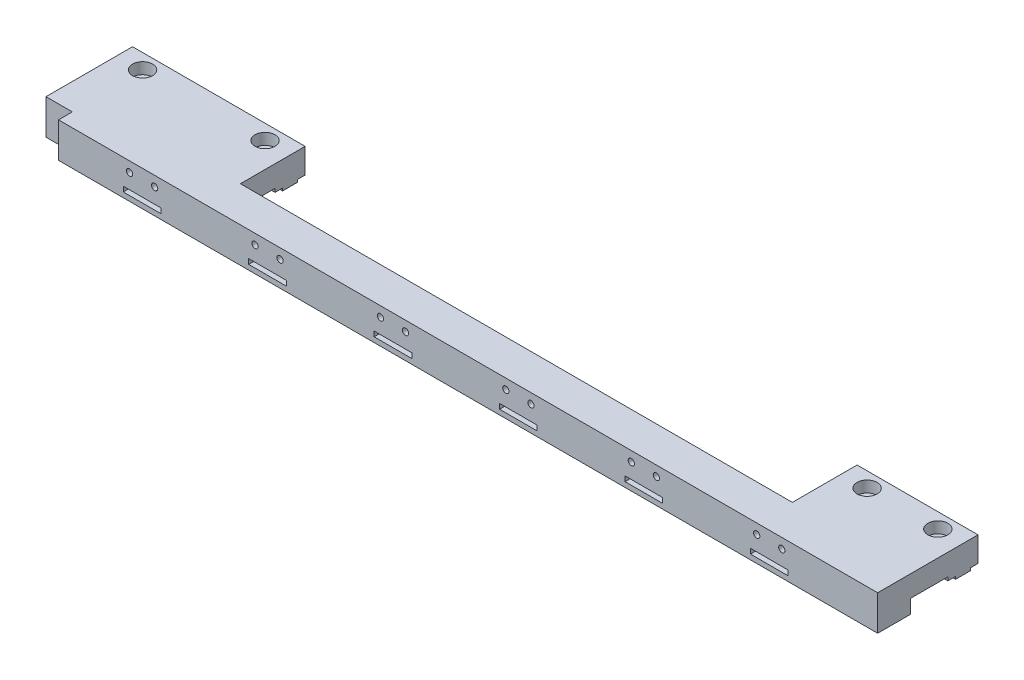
ISO-10303-21;
HEADER;
FILE_DESCRIPTION(('STEP AP214'),'2;1');
FILE_NAME('part.step','',(''),(''),'','','');
FILE_SCHEMA(('AUTOMOTIVE_DESIGN { 1 0 10303 214 1 1 1 1 }'));
ENDSEC;
DATA;
#1=APPLICATION_CONTEXT('core data for automotive mechanical design processes');
#2=APPLICATION_PROTOCOL_DEFINITION('international standard','automotive_design',2000,#1);
#3=PRODUCT_CONTEXT('',#1,'mechanical');
#4=PRODUCT('Part','Part','',(#3));
#5=PRODUCT_RELATED_PRODUCT_CATEGORY('part','',(#4));
#6=PRODUCT_DEFINITION_FORMATION('','',#4);
#7=PRODUCT_DEFINITION_CONTEXT('part definition',#1,'design');
#8=PRODUCT_DEFINITION('design','',#6,#7);
#9=PRODUCT_DEFINITION_SHAPE('','',#8);
#10=(LENGTH_UNIT() NAMED_UNIT(*) SI_UNIT(.MILLI.,.METRE.));
#11=(NAMED_UNIT(*) PLANE_ANGLE_UNIT() SI_UNIT($,.RADIAN.));
#12=(NAMED_UNIT(*) SI_UNIT($,.STERADIAN.) SOLID_ANGLE_UNIT());
#13=UNCERTAINTY_MEASURE_WITH_UNIT(LENGTH_MEASURE(1.E-05),#10,'distance_accuracy_value','');
#14=(GEOMETRIC_REPRESENTATION_CONTEXT(3) GLOBAL_UNCERTAINTY_ASSIGNED_CONTEXT((#13)) GLOBAL_UNIT_ASSIGNED_CONTEXT((#10,
#11,#12)) REPRESENTATION_CONTEXT('',''));
#15=CARTESIAN_POINT('',(0.,0.,0.));
#16=DIRECTION('',(0.,0.,1.));
#17=DIRECTION('',(1.,0.,0.));
#18=AXIS2_PLACEMENT_3D('',#15,#16,#17);
#19=CARTESIAN_POINT('',(58.7999999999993,0.,6.));
#20=DIRECTION('',(0.,1.,0.));
#21=DIRECTION('',(0.,0.,1.));
#22=AXIS2_PLACEMENT_3D('',#19,#20,#21);
#23=CYLINDRICAL_SURFACE('',#22,2.25);
#24=CARTESIAN_POINT('',(58.7999999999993,3.09999999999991,6.));
#25=DIRECTION('',(0.,-1.,0.));
#26=DIRECTION('',(0.,0.,-1.));
#27=AXIS2_PLACEMENT_3D('',#24,#25,#26);
#28=CIRCLE('',#27,2.25);
#29=CARTESIAN_POINT('',(58.7999999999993,3.09999999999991,3.75));
#30=VERTEX_POINT('',#29);
#31=EDGE_CURVE('E440',#30,#30,#28,.T.);
#32=ORIENTED_EDGE('',*,*,#31,.T.);
#33=EDGE_LOOP('',(#32));
#34=FACE_BOUND('',#33,.T.);
#35=CARTESIAN_POINT('',(58.7999999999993,9.5,6.));
#36=DIRECTION('',(0.,1.,0.));
#37=DIRECTION('',(0.,0.,1.));
#38=AXIS2_PLACEMENT_3D('',#35,#36,#37);
#39=CIRCLE('',#38,2.25);
#40=CARTESIAN_POINT('',(58.7999999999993,9.5,8.25));
#41=VERTEX_POINT('',#40);
#42=EDGE_CURVE('E38',#41,#41,#39,.F.);
#43=ORIENTED_EDGE('',*,*,#42,.F.);
#44=EDGE_LOOP('',(#43));
#45=FACE_BOUND('',#44,.T.);
#46=ADVANCED_FACE('F34',(#34,#45),#23,.F.);
#47=CARTESIAN_POINT('',(10.,0.,6.));
#48=DIRECTION('',(0.,1.,0.));
#49=DIRECTION('',(0.,0.,1.));
#50=AXIS2_PLACEMENT_3D('',#47,#48,#49);
#51=CYLINDRICAL_SURFACE('',#50,2.25);
#52=CARTESIAN_POINT('',(10.,3.09999999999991,6.));
#53=DIRECTION('',(0.,-1.,0.));
#54=DIRECTION('',(0.,0.,-1.));
#55=AXIS2_PLACEMENT_3D('',#52,#53,#54);
#56=CIRCLE('',#55,2.25);
#57=CARTESIAN_POINT('',(10.,3.09999999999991,3.75));
#58=VERTEX_POINT('',#57);
#59=EDGE_CURVE('E437',#58,#58,#56,.T.);
#60=ORIENTED_EDGE('',*,*,#59,.T.);
#61=EDGE_LOOP('',(#60));
#62=FACE_BOUND('',#61,.T.);
#63=CARTESIAN_POINT('',(10.,9.5,6.));
#64=DIRECTION('',(0.,1.,0.));
#65=DIRECTION('',(0.,0.,1.));
#66=AXIS2_PLACEMENT_3D('',#63,#64,#65);
#67=CIRCLE('',#66,2.25);
#68=CARTESIAN_POINT('',(10.,9.5,8.25));
#69=VERTEX_POINT('',#68);
#70=EDGE_CURVE('E455',#69,#69,#67,.F.);
#71=ORIENTED_EDGE('',*,*,#70,.F.);
#72=EDGE_LOOP('',(#71));
#73=FACE_BOUND('',#72,.T.);
#74=ADVANCED_FACE('F1014',(#62,#73),#51,.F.);
#75=CARTESIAN_POINT('',(327.,0.,6.));
#76=DIRECTION('',(0.,1.,0.));
#77=DIRECTION('',(0.,0.,1.));
#78=AXIS2_PLACEMENT_3D('',#75,#76,#77);
#79=CYLINDRICAL_SURFACE('',#78,2.24999999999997);
#80=CARTESIAN_POINT('',(327.,3.09999999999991,6.));
#81=DIRECTION('',(0.,-1.,0.));
#82=DIRECTION('',(0.,0.,-1.));
#83=AXIS2_PLACEMENT_3D('',#80,#81,#82);
#84=CIRCLE('',#83,2.24999999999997);
#85=CARTESIAN_POINT('',(327.,3.09999999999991,3.75000000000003));
#86=VERTEX_POINT('',#85);
#87=EDGE_CURVE('E434',#86,#86,#84,.T.);
#88=ORIENTED_EDGE('',*,*,#87,.T.);
#89=EDGE_LOOP('',(#88));
#90=FACE_BOUND('',#89,.T.);
#91=CARTESIAN_POINT('',(327.,9.5,6.));
#92=DIRECTION('',(0.,1.,0.));
#93=DIRECTION('',(0.,0.,1.));
#94=AXIS2_PLACEMENT_3D('',#91,#92,#93);
#95=CIRCLE('',#94,2.24999999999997);
#96=CARTESIAN_POINT('',(327.,9.5,8.24999999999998));
#97=VERTEX_POINT('',#96);
#98=EDGE_CURVE('E451',#97,#97,#95,.F.);
#99=ORIENTED_EDGE('',*,*,#98,.F.);
#100=EDGE_LOOP('',(#99));
#101=FACE_BOUND('',#100,.T.);
#102=ADVANCED_FACE('F1020',(#90,#101),#79,.F.);
#103=CARTESIAN_POINT('',(298.8,0.,6.));
#104=DIRECTION('',(0.,1.,0.));
#105=DIRECTION('',(0.,0.,1.));
#106=AXIS2_PLACEMENT_3D('',#103,#104,#105);
#107=CYLINDRICAL_SURFACE('',#106,2.24999999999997);
#108=CARTESIAN_POINT('',(298.8,4.,6.));
#109=DIRECTION('',(0.,1.,0.));
#110=DIRECTION('',(0.,0.,1.));
#111=AXIS2_PLACEMENT_3D('',#108,#109,#110);
#112=CIRCLE('',#111,2.24999999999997);
#113=CARTESIAN_POINT('',(298.8,4.,8.24999999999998));
#114=VERTEX_POINT('',#113);
#115=EDGE_CURVE('E430',#114,#114,#112,.T.);
#116=ORIENTED_EDGE('',*,*,#115,.F.);
#117=EDGE_LOOP('',(#116));
#118=FACE_BOUND('',#117,.T.);
#119=CARTESIAN_POINT('',(298.8,9.5,6.));
#120=DIRECTION('',(0.,1.,0.));
#121=DIRECTION('',(0.,0.,1.));
#122=AXIS2_PLACEMENT_3D('',#119,#120,#121);
#123=CIRCLE('',#122,2.24999999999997);
#124=CARTESIAN_POINT('',(298.8,9.5,8.24999999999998));
#125=VERTEX_POINT('',#124);
#126=EDGE_CURVE('E447',#125,#125,#123,.F.);
#127=ORIENTED_EDGE('',*,*,#126,.F.);
#128=EDGE_LOOP('',(#127));
#129=FACE_BOUND('',#128,.T.);
#130=ADVANCED_FACE('F1029',(#118,#129),#107,.F.);
#131=CARTESIAN_POINT('',(0.,0.,40.));
#132=DIRECTION('',(1.,0.,0.));
#133=DIRECTION('',(0.,0.,-1.));
#134=AXIS2_PLACEMENT_3D('',#131,#132,#133);
#135=PLANE('',#134);
#136=DIRECTION('',(0.,1.,0.));
#137=VECTOR('',#136,1.);
#138=CARTESIAN_POINT('',(0.,0.,34.5));
#139=LINE('',#138,#137);
#140=CARTESIAN_POINT('',(0.,0.,34.5));
#141=VERTEX_POINT('',#140);
#142=CARTESIAN_POINT('',(0.,14.,34.5));
#143=VERTEX_POINT('',#142);
#144=EDGE_CURVE('E390',#141,#143,#139,.T.);
#145=ORIENTED_EDGE('',*,*,#144,.T.);
#146=DIRECTION('',(0.,0.,-1.));
#147=VECTOR('',#146,1.);
#148=CARTESIAN_POINT('',(0.,14.,40.));
#149=LINE('',#148,#147);
#150=CARTESIAN_POINT('',(0.,14.,0.));
#151=VERTEX_POINT('',#150);
#152=EDGE_CURVE('E897',#143,#151,#149,.T.);
#153=ORIENTED_EDGE('',*,*,#152,.T.);
#154=DIRECTION('',(0.,-1.,0.));
#155=VECTOR('',#154,1.);
#156=CARTESIAN_POINT('',(0.,0.,0.));
#157=LINE('',#156,#155);
#158=CARTESIAN_POINT('',(0.,4.09999999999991,0.));
#159=VERTEX_POINT('',#158);
#160=EDGE_CURVE('E898',#151,#159,#157,.T.);
#161=ORIENTED_EDGE('',*,*,#160,.T.);
#162=DIRECTION('',(0.,0.,-1.));
#163=VECTOR('',#162,1.);
#164=CARTESIAN_POINT('',(0.,4.09999999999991,2.99999999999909));
#165=LINE('',#164,#163);
#166=CARTESIAN_POINT('',(0.,4.09999999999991,2.99999999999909));
#167=VERTEX_POINT('',#166);
#168=EDGE_CURVE('E579',#167,#159,#165,.T.);
#169=ORIENTED_EDGE('',*,*,#168,.F.);
#170=DIRECTION('',(0.,1.,0.));
#171=VECTOR('',#170,1.);
#172=CARTESIAN_POINT('',(0.,3.09999999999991,2.99999999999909));
#173=LINE('',#172,#171);
#174=CARTESIAN_POINT('',(0.,3.09999999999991,2.99999999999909));
#175=VERTEX_POINT('',#174);
#176=EDGE_CURVE('E575',#175,#167,#173,.T.);
#177=ORIENTED_EDGE('',*,*,#176,.F.);
#178=DIRECTION('',(0.,0.,-1.));
#179=VECTOR('',#178,1.);
#180=CARTESIAN_POINT('',(0.,3.09999999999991,8.99999999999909));
#181=LINE('',#180,#179);
#182=CARTESIAN_POINT('',(0.,3.09999999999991,8.99999999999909));
#183=VERTEX_POINT('',#182);
#184=EDGE_CURVE('E572',#183,#175,#181,.T.);
#185=ORIENTED_EDGE('',*,*,#184,.F.);
#186=DIRECTION('',(0.,-1.,0.));
#187=VECTOR('',#186,1.);
#188=CARTESIAN_POINT('',(0.,3.09999999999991,8.99999999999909));
#189=LINE('',#188,#187);
#190=CARTESIAN_POINT('',(0.,4.09999999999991,8.99999999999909));
#191=VERTEX_POINT('',#190);
#192=EDGE_CURVE('E591',#191,#183,#189,.T.);
#193=ORIENTED_EDGE('',*,*,#192,.F.);
#194=DIRECTION('',(0.,0.,-1.));
#195=VECTOR('',#194,1.);
#196=CARTESIAN_POINT('',(0.,4.09999999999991,11.9999999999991));
#197=LINE('',#196,#195);
#198=CARTESIAN_POINT('',(0.,4.09999999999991,11.9999999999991));
#199=VERTEX_POINT('',#198);
#200=EDGE_CURVE('E588',#199,#191,#197,.T.);
#201=ORIENTED_EDGE('',*,*,#200,.F.);
#202=DIRECTION('',(0.,-1.,0.));
#203=VECTOR('',#202,1.);
#204=CARTESIAN_POINT('',(0.,4.09999999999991,11.9999999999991));
#205=LINE('',#204,#203);
#206=CARTESIAN_POINT('',(0.,5.5,11.9999999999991));
#207=VERTEX_POINT('',#206);
#208=EDGE_CURVE('E585',#207,#199,#205,.T.);
#209=ORIENTED_EDGE('',*,*,#208,.F.);
#210=DIRECTION('',(0.,0.,-1.));
#211=VECTOR('',#210,1.);
#212=CARTESIAN_POINT('',(0.,5.5,26.9999999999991));
#213=LINE('',#212,#211);
#214=CARTESIAN_POINT('',(0.,5.5,26.9999999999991));
#215=VERTEX_POINT('',#214);
#216=EDGE_CURVE('E582',#215,#207,#213,.T.);
#217=ORIENTED_EDGE('',*,*,#216,.F.);
#218=DIRECTION('',(0.,1.,0.));
#219=VECTOR('',#218,1.);
#220=CARTESIAN_POINT('',(0.,0.,26.9999999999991));
#221=LINE('',#220,#219);
#222=CARTESIAN_POINT('',(0.,0.,26.9999999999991));
#223=VERTEX_POINT('',#222);
#224=EDGE_CURVE('E412',#223,#215,#221,.T.);
#225=ORIENTED_EDGE('',*,*,#224,.F.);
#226=DIRECTION('',(0.,0.,-1.));
#227=VECTOR('',#226,1.);
#228=CARTESIAN_POINT('',(0.,0.,40.));
#229=LINE('',#228,#227);
#230=EDGE_CURVE('E404',#141,#223,#229,.T.);
#231=ORIENTED_EDGE('',*,*,#230,.F.);
#232=EDGE_LOOP('',(#145,#153,#161,#169,#177,#185,#193,#201,#209,#217,#225,#231));
#233=FACE_BOUND('',#232,.T.);
#234=ADVANCED_FACE('F36',(#233),#135,.F.);
#235=CARTESIAN_POINT('',(0.,0.,40.));
#236=DIRECTION('',(0.,1.,0.));
#237=DIRECTION('',(0.,0.,1.));
#238=AXIS2_PLACEMENT_3D('',#235,#236,#237);
#239=PLANE('',#238);
#240=DIRECTION('',(0.,0.,1.));
#241=VECTOR('',#240,1.);
#242=CARTESIAN_POINT('',(10.5,0.,40.));
#243=LINE('',#242,#241);
#244=CARTESIAN_POINT('',(10.5,0.,34.5));
#245=VERTEX_POINT('',#244);
#246=CARTESIAN_POINT('',(10.5,0.,40.));
#247=VERTEX_POINT('',#246);
#248=EDGE_CURVE('E51',#245,#247,#243,.T.);
#249=ORIENTED_EDGE('',*,*,#248,.F.);
#250=DIRECTION('',(1.,0.,0.));
#251=VECTOR('',#250,1.);
#252=CARTESIAN_POINT('',(0.,0.,34.5));
#253=LINE('',#252,#251);
#254=EDGE_CURVE('E393',#141,#245,#253,.T.);
#255=ORIENTED_EDGE('',*,*,#254,.F.);
#256=ORIENTED_EDGE('',*,*,#230,.T.);
#257=DIRECTION('',(1.,0.,0.));
#258=VECTOR('',#257,1.);
#259=CARTESIAN_POINT('',(0.,0.,26.9999999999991));
#260=LINE('',#259,#258);
#261=CARTESIAN_POINT('',(337.,0.,26.9999999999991));
#262=VERTEX_POINT('',#261);
#263=EDGE_CURVE('E637',#223,#262,#260,.T.);
#264=ORIENTED_EDGE('',*,*,#263,.T.);
#265=DIRECTION('',(0.,0.,-1.));
#266=VECTOR('',#265,1.);
#267=CARTESIAN_POINT('',(337.,0.,40.));
#268=LINE('',#267,#266);
#269=CARTESIAN_POINT('',(337.,0.,40.));
#270=VERTEX_POINT('',#269);
#271=EDGE_CURVE('E414',#270,#262,#268,.T.);
#272=ORIENTED_EDGE('',*,*,#271,.F.);
#273=DIRECTION('',(1.,0.,0.));
#274=VECTOR('',#273,1.);
#275=CARTESIAN_POINT('',(0.,0.,40.));
#276=LINE('',#275,#274);
#277=EDGE_CURVE('E889',#247,#270,#276,.T.);
#278=ORIENTED_EDGE('',*,*,#277,.F.);
#279=EDGE_LOOP('',(#249,#255,#256,#264,#272,#278));
#280=FACE_BOUND('',#279,.T.);
#281=ADVANCED_FACE('F402',(#280),#239,.F.);
#282=CARTESIAN_POINT('',(0.,14.,0.));
#283=DIRECTION('',(0.,0.,-1.));
#284=DIRECTION('',(-1.,0.,0.));
#285=AXIS2_PLACEMENT_3D('',#282,#283,#284);
#286=PLANE('',#285);
#287=DIRECTION('',(-1.,0.,0.));
#288=VECTOR('',#287,1.);
#289=CARTESIAN_POINT('',(0.,14.,0.));
#290=LINE('',#289,#288);
#291=CARTESIAN_POINT('',(68.7999999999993,14.,0.));
#292=VERTEX_POINT('',#291);
#293=EDGE_CURVE('E903',#292,#151,#290,.T.);
#294=ORIENTED_EDGE('',*,*,#293,.F.);
#295=DIRECTION('',(0.,1.,0.));
#296=VECTOR('',#295,1.);
#297=CARTESIAN_POINT('',(68.7999999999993,0.,0.));
#298=LINE('',#297,#296);
#299=CARTESIAN_POINT('',(68.7999999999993,4.09999999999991,0.));
#300=VERTEX_POINT('',#299);
#301=EDGE_CURVE('E493',#300,#292,#298,.T.);
#302=ORIENTED_EDGE('',*,*,#301,.F.);
#303=DIRECTION('',(1.,0.,0.));
#304=VECTOR('',#303,1.);
#305=CARTESIAN_POINT('',(0.,4.09999999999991,-9.09494701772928E-13));
#306=LINE('',#305,#304);
#307=EDGE_CURVE('E639',#159,#300,#306,.T.);
#308=ORIENTED_EDGE('',*,*,#307,.F.);
#309=ORIENTED_EDGE('',*,*,#160,.F.);
#310=EDGE_LOOP('',(#294,#302,#308,#309));
#311=FACE_BOUND('',#310,.T.);
#312=ADVANCED_FACE('F988',(#311),#286,.T.);
#313=CARTESIAN_POINT('',(288.8,4.09999999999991,0.));
#314=VERTEX_POINT('',#313);
#315=CARTESIAN_POINT('',(337.,4.09999999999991,-9.09494701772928E-13));
#316=VERTEX_POINT('',#315);
#317=EDGE_CURVE('E642',#314,#316,#306,.T.);
#318=ORIENTED_EDGE('',*,*,#317,.F.);
#319=DIRECTION('',(0.,1.,0.));
#320=VECTOR('',#319,1.);
#321=CARTESIAN_POINT('',(288.8,0.,0.));
#322=LINE('',#321,#320);
#323=CARTESIAN_POINT('',(288.8,14.,0.));
#324=VERTEX_POINT('',#323);
#325=EDGE_CURVE('E501',#314,#324,#322,.T.);
#326=ORIENTED_EDGE('',*,*,#325,.T.);
#327=CARTESIAN_POINT('',(337.,14.,0.));
#328=VERTEX_POINT('',#327);
#329=EDGE_CURVE('E892',#328,#324,#290,.T.);
#330=ORIENTED_EDGE('',*,*,#329,.F.);
#331=DIRECTION('',(0.,1.,0.));
#332=VECTOR('',#331,1.);
#333=CARTESIAN_POINT('',(337.,0.,0.));
#334=LINE('',#333,#332);
#335=EDGE_CURVE('E901',#316,#328,#334,.T.);
#336=ORIENTED_EDGE('',*,*,#335,.F.);
#337=EDGE_LOOP('',(#318,#326,#330,#336));
#338=FACE_BOUND('',#337,.T.);
#339=ADVANCED_FACE('F917',(#338),#286,.T.);
#340=CARTESIAN_POINT('',(0.,14.,40.));
#341=DIRECTION('',(0.,-1.,0.));
#342=DIRECTION('',(0.,0.,-1.));
#343=AXIS2_PLACEMENT_3D('',#340,#341,#342);
#344=PLANE('',#343);
#345=CARTESIAN_POINT('',(58.7999999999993,14.,6.));
#346=DIRECTION('',(0.,1.,0.));
#347=DIRECTION('',(0.,0.,1.));
#348=AXIS2_PLACEMENT_3D('',#345,#346,#347);
#349=CIRCLE('',#348,4.);
#350=CARTESIAN_POINT('',(58.7999999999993,14.,10.));
#351=VERTEX_POINT('',#350);
#352=EDGE_CURVE('E471',#351,#351,#349,.T.);
#353=ORIENTED_EDGE('',*,*,#352,.F.);
#354=EDGE_LOOP('',(#353));
#355=FACE_BOUND('',#354,.T.);
#356=CARTESIAN_POINT('',(10.,14.,6.));
#357=DIRECTION('',(0.,1.,0.));
#358=DIRECTION('',(0.,0.,1.));
#359=AXIS2_PLACEMENT_3D('',#356,#357,#358);
#360=CIRCLE('',#359,4.);
#361=CARTESIAN_POINT('',(10.,14.,10.));
#362=VERTEX_POINT('',#361);
#363=EDGE_CURVE('E464',#362,#362,#360,.T.);
#364=ORIENTED_EDGE('',*,*,#363,.F.);
#365=EDGE_LOOP('',(#364));
#366=FACE_BOUND('',#365,.T.);
#367=CARTESIAN_POINT('',(327.,14.,6.));
#368=DIRECTION('',(0.,1.,0.));
#369=DIRECTION('',(0.,0.,1.));
#370=AXIS2_PLACEMENT_3D('',#367,#368,#369);
#371=CIRCLE('',#370,4.);
#372=CARTESIAN_POINT('',(327.,14.,10.));
#373=VERTEX_POINT('',#372);
#374=EDGE_CURVE('E457',#373,#373,#371,.T.);
#375=ORIENTED_EDGE('',*,*,#374,.F.);
#376=EDGE_LOOP('',(#375));
#377=FACE_BOUND('',#376,.T.);
#378=CARTESIAN_POINT('',(298.8,14.,6.));
#379=DIRECTION('',(0.,1.,0.));
#380=DIRECTION('',(0.,0.,1.));
#381=AXIS2_PLACEMENT_3D('',#378,#379,#380);
#382=CIRCLE('',#381,4.);
#383=CARTESIAN_POINT('',(298.8,14.,10.));
#384=VERTEX_POINT('',#383);
#385=EDGE_CURVE('E453',#384,#384,#382,.T.);
#386=ORIENTED_EDGE('',*,*,#385,.F.);
#387=EDGE_LOOP('',(#386));
#388=FACE_BOUND('',#387,.T.);
#389=DIRECTION('',(0.,0.,-1.));
#390=VECTOR('',#389,1.);
#391=CARTESIAN_POINT('',(68.8000000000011,14.,25.8000000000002));
#392=LINE('',#391,#390);
#393=CARTESIAN_POINT('',(68.8000000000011,14.,25.8000000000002));
#394=VERTEX_POINT('',#393);
#395=EDGE_CURVE('E407',#394,#292,#392,.T.);
#396=ORIENTED_EDGE('',*,*,#395,.T.);
#397=ORIENTED_EDGE('',*,*,#293,.T.);
#398=ORIENTED_EDGE('',*,*,#152,.F.);
#399=DIRECTION('',(1.,0.,0.));
#400=VECTOR('',#399,1.);
#401=CARTESIAN_POINT('',(0.,14.,34.5));
#402=LINE('',#401,#400);
#403=CARTESIAN_POINT('',(10.5,14.,34.5));
#404=VERTEX_POINT('',#403);
#405=EDGE_CURVE('E395',#143,#404,#402,.T.);
#406=ORIENTED_EDGE('',*,*,#405,.T.);
#407=DIRECTION('',(0.,0.,1.));
#408=VECTOR('',#407,1.);
#409=CARTESIAN_POINT('',(10.5,14.,40.));
#410=LINE('',#409,#408);
#411=CARTESIAN_POINT('',(10.5,14.,40.));
#412=VERTEX_POINT('',#411);
#413=EDGE_CURVE('E482',#404,#412,#410,.T.);
#414=ORIENTED_EDGE('',*,*,#413,.T.);
#415=DIRECTION('',(-1.,0.,0.));
#416=VECTOR('',#415,1.);
#417=CARTESIAN_POINT('',(0.,14.,40.));
#418=LINE('',#417,#416);
#419=CARTESIAN_POINT('',(337.,14.,40.));
#420=VERTEX_POINT('',#419);
#421=EDGE_CURVE('E894',#420,#412,#418,.T.);
#422=ORIENTED_EDGE('',*,*,#421,.F.);
#423=DIRECTION('',(0.,0.,-1.));
#424=VECTOR('',#423,1.);
#425=CARTESIAN_POINT('',(337.,14.,40.));
#426=LINE('',#425,#424);
#427=EDGE_CURVE('E419',#420,#328,#426,.T.);
#428=ORIENTED_EDGE('',*,*,#427,.T.);
#429=ORIENTED_EDGE('',*,*,#329,.T.);
#430=DIRECTION('',(0.,0.,1.));
#431=VECTOR('',#430,1.);
#432=CARTESIAN_POINT('',(288.8,14.,25.8000000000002));
#433=LINE('',#432,#431);
#434=CARTESIAN_POINT('',(288.8,14.,25.8000000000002));
#435=VERTEX_POINT('',#434);
#436=EDGE_CURVE('E485',#324,#435,#433,.T.);
#437=ORIENTED_EDGE('',*,*,#436,.T.);
#438=DIRECTION('',(-1.,0.,0.));
#439=VECTOR('',#438,1.);
#440=CARTESIAN_POINT('',(68.8000000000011,14.,25.8000000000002));
#441=LINE('',#440,#439);
#442=EDGE_CURVE('E488',#435,#394,#441,.T.);
#443=ORIENTED_EDGE('',*,*,#442,.T.);
#444=EDGE_LOOP('',(#396,#397,#398,#406,#414,#422,#428,#429,#437,#443));
#445=FACE_BOUND('',#444,.T.);
#446=ADVANCED_FACE('F911',(#355,#366,#377,#388,#445),#344,.F.);
#447=CARTESIAN_POINT('',(0.,14.,40.));
#448=DIRECTION('',(0.,0.,-1.));
#449=DIRECTION('',(-1.,0.,0.));
#450=AXIS2_PLACEMENT_3D('',#447,#448,#449);
#451=PLANE('',#450);
#452=DIRECTION('',(1.,0.,0.));
#453=VECTOR('',#452,1.);
#454=CARTESIAN_POINT('',(36.3000000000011,2.,40.));
#455=LINE('',#454,#453);
#456=CARTESIAN_POINT('',(36.3000000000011,2.,40.));
#457=VERTEX_POINT('',#456);
#458=CARTESIAN_POINT('',(51.3000000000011,2.,40.));
#459=VERTEX_POINT('',#458);
#460=EDGE_CURVE('E870',#457,#459,#455,.T.);
#461=ORIENTED_EDGE('',*,*,#460,.F.);
#462=DIRECTION('',(0.,-1.,0.));
#463=VECTOR('',#462,1.);
#464=CARTESIAN_POINT('',(36.3000000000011,4.,40.));
#465=LINE('',#464,#463);
#466=CARTESIAN_POINT('',(36.3000000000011,4.,40.));
#467=VERTEX_POINT('',#466);
#468=EDGE_CURVE('E862',#467,#457,#465,.T.);
#469=ORIENTED_EDGE('',*,*,#468,.F.);
#470=DIRECTION('',(-1.,0.,0.));
#471=VECTOR('',#470,1.);
#472=CARTESIAN_POINT('',(36.3000000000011,4.,40.));
#473=LINE('',#472,#471);
#474=CARTESIAN_POINT('',(51.3000000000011,4.,40.));
#475=VERTEX_POINT('',#474);
#476=EDGE_CURVE('E876',#475,#467,#473,.T.);
#477=ORIENTED_EDGE('',*,*,#476,.F.);
#478=DIRECTION('',(0.,1.,0.));
#479=VECTOR('',#478,1.);
#480=CARTESIAN_POINT('',(51.3000000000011,4.,40.));
#481=LINE('',#480,#479);
#482=EDGE_CURVE('E873',#459,#475,#481,.T.);
#483=ORIENTED_EDGE('',*,*,#482,.F.);
#484=EDGE_LOOP('',(#461,#469,#477,#483));
#485=FACE_BOUND('',#484,.T.);
#486=DIRECTION('',(1.,0.,0.));
#487=VECTOR('',#486,1.);
#488=CARTESIAN_POINT('',(86.3000000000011,2.,40.));
#489=LINE('',#488,#487);
#490=CARTESIAN_POINT('',(86.3000000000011,2.,40.));
#491=VERTEX_POINT('',#490);
#492=CARTESIAN_POINT('',(101.300000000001,2.,40.));
#493=VERTEX_POINT('',#492);
#494=EDGE_CURVE('E850',#491,#493,#489,.T.);
#495=ORIENTED_EDGE('',*,*,#494,.F.);
#496=DIRECTION('',(0.,-1.,0.));
#497=VECTOR('',#496,1.);
#498=CARTESIAN_POINT('',(86.3000000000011,4.,40.));
#499=LINE('',#498,#497);
#500=CARTESIAN_POINT('',(86.3000000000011,4.,40.));
#501=VERTEX_POINT('',#500);
#502=EDGE_CURVE('E842',#501,#491,#499,.T.);
#503=ORIENTED_EDGE('',*,*,#502,.F.);
#504=DIRECTION('',(-1.,0.,0.));
#505=VECTOR('',#504,1.);
#506=CARTESIAN_POINT('',(86.3000000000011,4.,40.));
#507=LINE('',#506,#505);
#508=CARTESIAN_POINT('',(101.300000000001,4.,40.));
#509=VERTEX_POINT('',#508);
#510=EDGE_CURVE('E856',#509,#501,#507,.T.);
#511=ORIENTED_EDGE('',*,*,#510,.F.);
#512=DIRECTION('',(0.,1.,0.));
#513=VECTOR('',#512,1.);
#514=CARTESIAN_POINT('',(101.300000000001,4.,40.));
#515=LINE('',#514,#513);
#516=EDGE_CURVE('E853',#493,#509,#515,.T.);
#517=ORIENTED_EDGE('',*,*,#516,.F.);
#518=EDGE_LOOP('',(#495,#503,#511,#517));
#519=FACE_BOUND('',#518,.T.);
#520=DIRECTION('',(1.,0.,0.));
#521=VECTOR('',#520,1.);
#522=CARTESIAN_POINT('',(136.300000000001,2.,40.));
#523=LINE('',#522,#521);
#524=CARTESIAN_POINT('',(136.300000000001,2.,40.));
#525=VERTEX_POINT('',#524);
#526=CARTESIAN_POINT('',(151.300000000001,2.,40.));
#527=VERTEX_POINT('',#526);
#528=EDGE_CURVE('E830',#525,#527,#523,.T.);
#529=ORIENTED_EDGE('',*,*,#528,.F.);
#530=DIRECTION('',(0.,-1.,0.));
#531=VECTOR('',#530,1.);
#532=CARTESIAN_POINT('',(136.300000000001,4.,40.));
#533=LINE('',#532,#531);
#534=CARTESIAN_POINT('',(136.300000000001,4.,40.));
#535=VERTEX_POINT('',#534);
#536=EDGE_CURVE('E822',#535,#525,#533,.T.);
#537=ORIENTED_EDGE('',*,*,#536,.F.);
#538=DIRECTION('',(-1.,0.,0.));
#539=VECTOR('',#538,1.);
#540=CARTESIAN_POINT('',(136.300000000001,4.,40.));
#541=LINE('',#540,#539);
#542=CARTESIAN_POINT('',(151.300000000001,4.,40.));
#543=VERTEX_POINT('',#542);
#544=EDGE_CURVE('E836',#543,#535,#541,.T.);
#545=ORIENTED_EDGE('',*,*,#544,.F.);
#546=DIRECTION('',(0.,1.,0.));
#547=VECTOR('',#546,1.);
#548=CARTESIAN_POINT('',(151.300000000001,4.,40.));
#549=LINE('',#548,#547);
#550=EDGE_CURVE('E833',#527,#543,#549,.T.);
#551=ORIENTED_EDGE('',*,*,#550,.F.);
#552=EDGE_LOOP('',(#529,#537,#545,#551));
#553=FACE_BOUND('',#552,.T.);
#554=DIRECTION('',(1.,0.,0.));
#555=VECTOR('',#554,1.);
#556=CARTESIAN_POINT('',(186.300000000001,2.,40.));
#557=LINE('',#556,#555);
#558=CARTESIAN_POINT('',(186.300000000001,2.,40.));
#559=VERTEX_POINT('',#558);
#560=CARTESIAN_POINT('',(201.300000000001,2.,40.));
#561=VERTEX_POINT('',#560);
#562=EDGE_CURVE('E810',#559,#561,#557,.T.);
#563=ORIENTED_EDGE('',*,*,#562,.F.);
#564=DIRECTION('',(0.,-1.,0.));
#565=VECTOR('',#564,1.);
#566=CARTESIAN_POINT('',(186.300000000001,4.,40.));
#567=LINE('',#566,#565);
#568=CARTESIAN_POINT('',(186.300000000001,4.,40.));
#569=VERTEX_POINT('',#568);
#570=EDGE_CURVE('E802',#569,#559,#567,.T.);
#571=ORIENTED_EDGE('',*,*,#570,.F.);
#572=DIRECTION('',(-1.,0.,0.));
#573=VECTOR('',#572,1.);
#574=CARTESIAN_POINT('',(186.300000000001,4.,40.));
#575=LINE('',#574,#573);
#576=CARTESIAN_POINT('',(201.300000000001,4.,40.));
#577=VERTEX_POINT('',#576);
#578=EDGE_CURVE('E816',#577,#569,#575,.T.);
#579=ORIENTED_EDGE('',*,*,#578,.F.);
#580=DIRECTION('',(0.,1.,0.));
#581=VECTOR('',#580,1.);
#582=CARTESIAN_POINT('',(201.300000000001,4.,40.));
#583=LINE('',#582,#581);
#584=EDGE_CURVE('E813',#561,#577,#583,.T.);
#585=ORIENTED_EDGE('',*,*,#584,.F.);
#586=EDGE_LOOP('',(#563,#571,#579,#585));
#587=FACE_BOUND('',#586,.T.);
#588=DIRECTION('',(1.,0.,0.));
#589=VECTOR('',#588,1.);
#590=CARTESIAN_POINT('',(236.300000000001,2.,40.));
#591=LINE('',#590,#589);
#592=CARTESIAN_POINT('',(236.300000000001,2.,40.));
#593=VERTEX_POINT('',#592);
#594=CARTESIAN_POINT('',(251.3,2.,40.));
#595=VERTEX_POINT('',#594);
#596=EDGE_CURVE('E790',#593,#595,#591,.T.);
#597=ORIENTED_EDGE('',*,*,#596,.F.);
#598=DIRECTION('',(0.,-1.,0.));
#599=VECTOR('',#598,1.);
#600=CARTESIAN_POINT('',(236.300000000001,4.,40.));
#601=LINE('',#600,#599);
#602=CARTESIAN_POINT('',(236.300000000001,4.,40.));
#603=VERTEX_POINT('',#602);
#604=EDGE_CURVE('E781',#603,#593,#601,.T.);
#605=ORIENTED_EDGE('',*,*,#604,.F.);
#606=DIRECTION('',(-1.,0.,0.));
#607=VECTOR('',#606,1.);
#608=CARTESIAN_POINT('',(236.300000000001,4.,40.));
#609=LINE('',#608,#607);
#610=CARTESIAN_POINT('',(251.3,4.,40.));
#611=VERTEX_POINT('',#610);
#612=EDGE_CURVE('E796',#611,#603,#609,.T.);
#613=ORIENTED_EDGE('',*,*,#612,.F.);
#614=DIRECTION('',(0.,1.,0.));
#615=VECTOR('',#614,1.);
#616=CARTESIAN_POINT('',(251.3,4.,40.));
#617=LINE('',#616,#615);
#618=EDGE_CURVE('E793',#595,#611,#617,.T.);
#619=ORIENTED_EDGE('',*,*,#618,.F.);
#620=EDGE_LOOP('',(#597,#605,#613,#619));
#621=FACE_BOUND('',#620,.T.);
#622=DIRECTION('',(1.,0.,0.));
#623=VECTOR('',#622,1.);
#624=CARTESIAN_POINT('',(286.3,2.,40.));
#625=LINE('',#624,#623);
#626=CARTESIAN_POINT('',(286.3,2.,40.));
#627=VERTEX_POINT('',#626);
#628=CARTESIAN_POINT('',(301.3,2.,40.));
#629=VERTEX_POINT('',#628);
#630=EDGE_CURVE('E769',#627,#629,#625,.T.);
#631=ORIENTED_EDGE('',*,*,#630,.F.);
#632=DIRECTION('',(0.,-1.,0.));
#633=VECTOR('',#632,1.);
#634=CARTESIAN_POINT('',(286.3,4.,40.));
#635=LINE('',#634,#633);
#636=CARTESIAN_POINT('',(286.3,4.,40.));
#637=VERTEX_POINT('',#636);
#638=EDGE_CURVE('E764',#637,#627,#635,.T.);
#639=ORIENTED_EDGE('',*,*,#638,.F.);
#640=DIRECTION('',(-1.,0.,0.));
#641=VECTOR('',#640,1.);
#642=CARTESIAN_POINT('',(286.3,4.,40.));
#643=LINE('',#642,#641);
#644=CARTESIAN_POINT('',(301.3,4.,40.));
#645=VERTEX_POINT('',#644);
#646=EDGE_CURVE('E775',#645,#637,#643,.T.);
#647=ORIENTED_EDGE('',*,*,#646,.F.);
#648=DIRECTION('',(0.,1.,0.));
#649=VECTOR('',#648,1.);
#650=CARTESIAN_POINT('',(301.3,4.,40.));
#651=LINE('',#650,#649);
#652=EDGE_CURVE('E772',#629,#645,#651,.T.);
#653=ORIENTED_EDGE('',*,*,#652,.F.);
#654=EDGE_LOOP('',(#631,#639,#647,#653));
#655=FACE_BOUND('',#654,.T.);
#656=CARTESIAN_POINT('',(38.8000000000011,10.,40.));
#657=DIRECTION('',(0.,0.,1.));
#658=DIRECTION('',(1.,0.,0.));
#659=AXIS2_PLACEMENT_3D('',#656,#657,#658);
#660=CIRCLE('',#659,1.25);
#661=CARTESIAN_POINT('',(40.0500000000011,10.,40.));
#662=VERTEX_POINT('',#661);
#663=EDGE_CURVE('E758',#662,#662,#660,.T.);
#664=ORIENTED_EDGE('',*,*,#663,.F.);
#665=EDGE_LOOP('',(#664));
#666=FACE_BOUND('',#665,.T.);
#667=CARTESIAN_POINT('',(48.8000000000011,10.,40.));
#668=DIRECTION('',(0.,0.,1.));
#669=DIRECTION('',(1.,0.,0.));
#670=AXIS2_PLACEMENT_3D('',#667,#668,#669);
#671=CIRCLE('',#670,1.25);
#672=CARTESIAN_POINT('',(50.0500000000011,10.,40.));
#673=VERTEX_POINT('',#672);
#674=EDGE_CURVE('E754',#673,#673,#671,.T.);
#675=ORIENTED_EDGE('',*,*,#674,.F.);
#676=EDGE_LOOP('',(#675));
#677=FACE_BOUND('',#676,.T.);
#678=CARTESIAN_POINT('',(88.8000000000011,10.,40.));
#679=DIRECTION('',(0.,0.,1.));
#680=DIRECTION('',(1.,0.,0.));
#681=AXIS2_PLACEMENT_3D('',#678,#679,#680);
#682=CIRCLE('',#681,1.25);
#683=CARTESIAN_POINT('',(90.0500000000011,10.,40.));
#684=VERTEX_POINT('',#683);
#685=EDGE_CURVE('E751',#684,#684,#682,.T.);
#686=ORIENTED_EDGE('',*,*,#685,.F.);
#687=EDGE_LOOP('',(#686));
#688=FACE_BOUND('',#687,.T.);
#689=CARTESIAN_POINT('',(98.8000000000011,10.,40.));
#690=DIRECTION('',(0.,0.,1.));
#691=DIRECTION('',(1.,0.,0.));
#692=AXIS2_PLACEMENT_3D('',#689,#690,#691);
#693=CIRCLE('',#692,1.25);
#694=CARTESIAN_POINT('',(100.050000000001,10.,40.));
#695=VERTEX_POINT('',#694);
#696=EDGE_CURVE('E748',#695,#695,#693,.T.);
#697=ORIENTED_EDGE('',*,*,#696,.F.);
#698=EDGE_LOOP('',(#697));
#699=FACE_BOUND('',#698,.T.);
#700=CARTESIAN_POINT('',(138.800000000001,10.,40.));
#701=DIRECTION('',(0.,0.,1.));
#702=DIRECTION('',(1.,0.,0.));
#703=AXIS2_PLACEMENT_3D('',#700,#701,#702);
#704=CIRCLE('',#703,1.25);
#705=CARTESIAN_POINT('',(140.050000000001,10.,40.));
#706=VERTEX_POINT('',#705);
#707=EDGE_CURVE('E745',#706,#706,#704,.T.);
#708=ORIENTED_EDGE('',*,*,#707,.F.);
#709=EDGE_LOOP('',(#708));
#710=FACE_BOUND('',#709,.T.);
#711=CARTESIAN_POINT('',(148.800000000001,10.,40.));
#712=DIRECTION('',(0.,0.,1.));
#713=DIRECTION('',(1.,0.,0.));
#714=AXIS2_PLACEMENT_3D('',#711,#712,#713);
#715=CIRCLE('',#714,1.25);
#716=CARTESIAN_POINT('',(150.050000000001,10.,40.));
#717=VERTEX_POINT('',#716);
#718=EDGE_CURVE('E742',#717,#717,#715,.T.);
#719=ORIENTED_EDGE('',*,*,#718,.F.);
#720=EDGE_LOOP('',(#719));
#721=FACE_BOUND('',#720,.T.);
#722=CARTESIAN_POINT('',(188.800000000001,10.,40.));
#723=DIRECTION('',(0.,0.,1.));
#724=DIRECTION('',(1.,0.,0.));
#725=AXIS2_PLACEMENT_3D('',#722,#723,#724);
#726=CIRCLE('',#725,1.25);
#727=CARTESIAN_POINT('',(190.050000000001,10.,40.));
#728=VERTEX_POINT('',#727);
#729=EDGE_CURVE('E739',#728,#728,#726,.T.);
#730=ORIENTED_EDGE('',*,*,#729,.F.);
#731=EDGE_LOOP('',(#730));
#732=FACE_BOUND('',#731,.T.);
#733=CARTESIAN_POINT('',(198.800000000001,10.,40.));
#734=DIRECTION('',(0.,0.,1.));
#735=DIRECTION('',(1.,0.,0.));
#736=AXIS2_PLACEMENT_3D('',#733,#734,#735);
#737=CIRCLE('',#736,1.25);
#738=CARTESIAN_POINT('',(200.050000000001,10.,40.));
#739=VERTEX_POINT('',#738);
#740=EDGE_CURVE('E736',#739,#739,#737,.T.);
#741=ORIENTED_EDGE('',*,*,#740,.F.);
#742=EDGE_LOOP('',(#741));
#743=FACE_BOUND('',#742,.T.);
#744=CARTESIAN_POINT('',(238.800000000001,10.,40.));
#745=DIRECTION('',(0.,0.,1.));
#746=DIRECTION('',(1.,0.,0.));
#747=AXIS2_PLACEMENT_3D('',#744,#745,#746);
#748=CIRCLE('',#747,1.25);
#749=CARTESIAN_POINT('',(240.050000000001,10.,40.));
#750=VERTEX_POINT('',#749);
#751=EDGE_CURVE('E733',#750,#750,#748,.T.);
#752=ORIENTED_EDGE('',*,*,#751,.F.);
#753=EDGE_LOOP('',(#752));
#754=FACE_BOUND('',#753,.T.);
#755=CARTESIAN_POINT('',(248.8,10.,40.));
#756=DIRECTION('',(0.,0.,1.));
#757=DIRECTION('',(1.,0.,0.));
#758=AXIS2_PLACEMENT_3D('',#755,#756,#757);
#759=CIRCLE('',#758,1.24999999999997);
#760=CARTESIAN_POINT('',(250.05,10.,40.));
#761=VERTEX_POINT('',#760);
#762=EDGE_CURVE('E728',#761,#761,#759,.T.);
#763=ORIENTED_EDGE('',*,*,#762,.F.);
#764=EDGE_LOOP('',(#763));
#765=FACE_BOUND('',#764,.T.);
#766=CARTESIAN_POINT('',(288.8,10.,40.));
#767=DIRECTION('',(0.,0.,1.));
#768=DIRECTION('',(1.,0.,0.));
#769=AXIS2_PLACEMENT_3D('',#766,#767,#768);
#770=CIRCLE('',#769,1.24999999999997);
#771=CARTESIAN_POINT('',(290.05,10.,40.));
#772=VERTEX_POINT('',#771);
#773=EDGE_CURVE('E722',#772,#772,#770,.T.);
#774=ORIENTED_EDGE('',*,*,#773,.F.);
#775=EDGE_LOOP('',(#774));
#776=FACE_BOUND('',#775,.T.);
#777=CARTESIAN_POINT('',(298.8,10.,40.));
#778=DIRECTION('',(0.,0.,1.));
#779=DIRECTION('',(1.,0.,0.));
#780=AXIS2_PLACEMENT_3D('',#777,#778,#779);
#781=CIRCLE('',#780,1.24999999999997);
#782=CARTESIAN_POINT('',(300.05,10.,40.));
#783=VERTEX_POINT('',#782);
#784=EDGE_CURVE('E718',#783,#783,#781,.T.);
#785=ORIENTED_EDGE('',*,*,#784,.F.);
#786=EDGE_LOOP('',(#785));
#787=FACE_BOUND('',#786,.T.);
#788=DIRECTION('',(0.,1.,0.));
#789=VECTOR('',#788,1.);
#790=CARTESIAN_POINT('',(10.5,0.,40.));
#791=LINE('',#790,#789);
#792=EDGE_CURVE('E504',#247,#412,#791,.T.);
#793=ORIENTED_EDGE('',*,*,#792,.F.);
#794=ORIENTED_EDGE('',*,*,#277,.T.);
#795=DIRECTION('',(0.,1.,0.));
#796=VECTOR('',#795,1.);
#797=CARTESIAN_POINT('',(337.,0.,40.));
#798=LINE('',#797,#796);
#799=EDGE_CURVE('E891',#270,#420,#798,.T.);
#800=ORIENTED_EDGE('',*,*,#799,.T.);
#801=ORIENTED_EDGE('',*,*,#421,.T.);
#802=EDGE_LOOP('',(#793,#794,#800,#801));
#803=FACE_BOUND('',#802,.T.);
#804=ADVANCED_FACE('F1103',(#485,#519,#553,#587,#621,#655,#666,#677,#688,#699,#710,#721,#732,
#743,#754,#765,#776,#787,#803),#451,.F.);
#805=CARTESIAN_POINT('',(88.8000000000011,10.,25.));
#806=DIRECTION('',(0.,0.,1.));
#807=DIRECTION('',(1.,0.,0.));
#808=AXIS2_PLACEMENT_3D('',#805,#806,#807);
#809=CYLINDRICAL_SURFACE('',#808,1.25);
#810=ORIENTED_EDGE('',*,*,#685,.T.);
#811=EDGE_LOOP('',(#810));
#812=FACE_BOUND('',#811,.T.);
#813=CARTESIAN_POINT('',(88.8000000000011,10.,25.8000000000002));
#814=DIRECTION('',(0.,0.,-1.));
#815=DIRECTION('',(-1.,0.,0.));
#816=AXIS2_PLACEMENT_3D('',#813,#814,#815);
#817=CIRCLE('',#816,1.25);
#818=CARTESIAN_POINT('',(87.5500000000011,10.,25.8000000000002));
#819=VERTEX_POINT('',#818);
#820=EDGE_CURVE('E443',#819,#819,#817,.F.);
#821=ORIENTED_EDGE('',*,*,#820,.F.);
#822=EDGE_LOOP('',(#821));
#823=FACE_BOUND('',#822,.T.);
#824=ADVANCED_FACE('F1099',(#812,#823),#809,.F.);
#825=CARTESIAN_POINT('',(98.8000000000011,10.,25.));
#826=DIRECTION('',(0.,0.,1.));
#827=DIRECTION('',(1.,0.,0.));
#828=AXIS2_PLACEMENT_3D('',#825,#826,#827);
#829=CYLINDRICAL_SURFACE('',#828,1.25);
#830=ORIENTED_EDGE('',*,*,#696,.T.);
#831=EDGE_LOOP('',(#830));
#832=FACE_BOUND('',#831,.T.);
#833=CARTESIAN_POINT('',(98.8000000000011,10.,25.8000000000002));
#834=DIRECTION('',(0.,0.,-1.));
#835=DIRECTION('',(-1.,0.,0.));
#836=AXIS2_PLACEMENT_3D('',#833,#834,#835);
#837=CIRCLE('',#836,1.25);
#838=CARTESIAN_POINT('',(97.5500000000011,10.,25.8000000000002));
#839=VERTEX_POINT('',#838);
#840=EDGE_CURVE('E567',#839,#839,#837,.F.);
#841=ORIENTED_EDGE('',*,*,#840,.F.);
#842=EDGE_LOOP('',(#841));
#843=FACE_BOUND('',#842,.T.);
#844=ADVANCED_FACE('F1095',(#832,#843),#829,.F.);
#845=CARTESIAN_POINT('',(138.800000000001,10.,25.));
#846=DIRECTION('',(0.,0.,1.));
#847=DIRECTION('',(1.,0.,0.));
#848=AXIS2_PLACEMENT_3D('',#845,#846,#847);
#849=CYLINDRICAL_SURFACE('',#848,1.25);
#850=ORIENTED_EDGE('',*,*,#707,.T.);
#851=EDGE_LOOP('',(#850));
#852=FACE_BOUND('',#851,.T.);
#853=CARTESIAN_POINT('',(138.800000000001,10.,25.8000000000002));
#854=DIRECTION('',(0.,0.,-1.));
#855=DIRECTION('',(-1.,0.,0.));
#856=AXIS2_PLACEMENT_3D('',#853,#854,#855);
#857=CIRCLE('',#856,1.25);
#858=CARTESIAN_POINT('',(137.550000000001,10.,25.8000000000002));
#859=VERTEX_POINT('',#858);
#860=EDGE_CURVE('E564',#859,#859,#857,.F.);
#861=ORIENTED_EDGE('',*,*,#860,.F.);
#862=EDGE_LOOP('',(#861));
#863=FACE_BOUND('',#862,.T.);
#864=ADVANCED_FACE('F1091',(#852,#863),#849,.F.);
#865=CARTESIAN_POINT('',(148.800000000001,10.,25.));
#866=DIRECTION('',(0.,0.,1.));
#867=DIRECTION('',(1.,0.,0.));
#868=AXIS2_PLACEMENT_3D('',#865,#866,#867);
#869=CYLINDRICAL_SURFACE('',#868,1.25);
#870=ORIENTED_EDGE('',*,*,#718,.T.);
#871=EDGE_LOOP('',(#870));
#872=FACE_BOUND('',#871,.T.);
#873=CARTESIAN_POINT('',(148.800000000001,10.,25.8000000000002));
#874=DIRECTION('',(0.,0.,-1.));
#875=DIRECTION('',(-1.,0.,0.));
#876=AXIS2_PLACEMENT_3D('',#873,#874,#875);
#877=CIRCLE('',#876,1.25);
#878=CARTESIAN_POINT('',(147.550000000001,10.,25.8000000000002));
#879=VERTEX_POINT('',#878);
#880=EDGE_CURVE('E561',#879,#879,#877,.F.);
#881=ORIENTED_EDGE('',*,*,#880,.F.);
#882=EDGE_LOOP('',(#881));
#883=FACE_BOUND('',#882,.T.);
#884=ADVANCED_FACE('F1087',(#872,#883),#869,.F.);
#885=CARTESIAN_POINT('',(188.800000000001,10.,25.));
#886=DIRECTION('',(0.,0.,1.));
#887=DIRECTION('',(1.,0.,0.));
#888=AXIS2_PLACEMENT_3D('',#885,#886,#887);
#889=CYLINDRICAL_SURFACE('',#888,1.25);
#890=ORIENTED_EDGE('',*,*,#729,.T.);
#891=EDGE_LOOP('',(#890));
#892=FACE_BOUND('',#891,.T.);
#893=CARTESIAN_POINT('',(188.800000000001,10.,25.8000000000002));
#894=DIRECTION('',(0.,0.,-1.));
#895=DIRECTION('',(-1.,0.,0.));
#896=AXIS2_PLACEMENT_3D('',#893,#894,#895);
#897=CIRCLE('',#896,1.25);
#898=CARTESIAN_POINT('',(187.550000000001,10.,25.8000000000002));
#899=VERTEX_POINT('',#898);
#900=EDGE_CURVE('E558',#899,#899,#897,.F.);
#901=ORIENTED_EDGE('',*,*,#900,.F.);
#902=EDGE_LOOP('',(#901));
#903=FACE_BOUND('',#902,.T.);
#904=ADVANCED_FACE('F1083',(#892,#903),#889,.F.);
#905=CARTESIAN_POINT('',(198.800000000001,10.,25.));
#906=DIRECTION('',(0.,0.,1.));
#907=DIRECTION('',(1.,0.,0.));
#908=AXIS2_PLACEMENT_3D('',#905,#906,#907);
#909=CYLINDRICAL_SURFACE('',#908,1.25);
#910=ORIENTED_EDGE('',*,*,#740,.T.);
#911=EDGE_LOOP('',(#910));
#912=FACE_BOUND('',#911,.T.);
#913=CARTESIAN_POINT('',(198.800000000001,10.,25.8000000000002));
#914=DIRECTION('',(0.,0.,-1.));
#915=DIRECTION('',(-1.,0.,0.));
#916=AXIS2_PLACEMENT_3D('',#913,#914,#915);
#917=CIRCLE('',#916,1.25);
#918=CARTESIAN_POINT('',(197.550000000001,10.,25.8000000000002));
#919=VERTEX_POINT('',#918);
#920=EDGE_CURVE('E555',#919,#919,#917,.F.);
#921=ORIENTED_EDGE('',*,*,#920,.F.);
#922=EDGE_LOOP('',(#921));
#923=FACE_BOUND('',#922,.T.);
#924=ADVANCED_FACE('F1079',(#912,#923),#909,.F.);
#925=CARTESIAN_POINT('',(238.800000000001,10.,25.));
#926=DIRECTION('',(0.,0.,1.));
#927=DIRECTION('',(1.,0.,0.));
#928=AXIS2_PLACEMENT_3D('',#925,#926,#927);
#929=CYLINDRICAL_SURFACE('',#928,1.25);
#930=ORIENTED_EDGE('',*,*,#751,.T.);
#931=EDGE_LOOP('',(#930));
#932=FACE_BOUND('',#931,.T.);
#933=CARTESIAN_POINT('',(238.800000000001,10.,25.8000000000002));
#934=DIRECTION('',(0.,0.,-1.));
#935=DIRECTION('',(-1.,0.,0.));
#936=AXIS2_PLACEMENT_3D('',#933,#934,#935);
#937=CIRCLE('',#936,1.25);
#938=CARTESIAN_POINT('',(237.550000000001,10.,25.8000000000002));
#939=VERTEX_POINT('',#938);
#940=EDGE_CURVE('E552',#939,#939,#937,.F.);
#941=ORIENTED_EDGE('',*,*,#940,.F.);
#942=EDGE_LOOP('',(#941));
#943=FACE_BOUND('',#942,.T.);
#944=ADVANCED_FACE('F1075',(#932,#943),#929,.F.);
#945=CARTESIAN_POINT('',(248.8,10.,25.));
#946=DIRECTION('',(0.,0.,1.));
#947=DIRECTION('',(1.,0.,0.));
#948=AXIS2_PLACEMENT_3D('',#945,#946,#947);
#949=CYLINDRICAL_SURFACE('',#948,1.24999999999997);
#950=ORIENTED_EDGE('',*,*,#762,.T.);
#951=EDGE_LOOP('',(#950));
#952=FACE_BOUND('',#951,.T.);
#953=CARTESIAN_POINT('',(248.8,10.,25.8000000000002));
#954=DIRECTION('',(0.,0.,-1.));
#955=DIRECTION('',(-1.,0.,0.));
#956=AXIS2_PLACEMENT_3D('',#953,#954,#955);
#957=CIRCLE('',#956,1.24999999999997);
#958=CARTESIAN_POINT('',(247.55,10.,25.8000000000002));
#959=VERTEX_POINT('',#958);
#960=EDGE_CURVE('E549',#959,#959,#957,.F.);
#961=ORIENTED_EDGE('',*,*,#960,.F.);
#962=EDGE_LOOP('',(#961));
#963=FACE_BOUND('',#962,.T.);
#964=ADVANCED_FACE('F1071',(#952,#963),#949,.F.);
#965=CARTESIAN_POINT('',(288.8,10.,25.));
#966=DIRECTION('',(0.,0.,1.));
#967=DIRECTION('',(1.,0.,0.));
#968=AXIS2_PLACEMENT_3D('',#965,#966,#967);
#969=CYLINDRICAL_SURFACE('',#968,1.24999999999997);
#970=ORIENTED_EDGE('',*,*,#773,.T.);
#971=EDGE_LOOP('',(#970));
#972=FACE_BOUND('',#971,.T.);
#973=DIRECTION('',(0.,0.,1.));
#974=VECTOR('',#973,1.);
#975=CARTESIAN_POINT('',(288.8,8.75000000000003,25.));
#976=LINE('',#975,#974);
#977=CARTESIAN_POINT('',(288.8,8.75000000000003,25.8000000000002));
#978=VERTEX_POINT('',#977);
#979=CARTESIAN_POINT('',(288.8,8.75000000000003,25.));
#980=VERTEX_POINT('',#979);
#981=EDGE_CURVE('E59',#978,#980,#976,.F.);
#982=ORIENTED_EDGE('',*,*,#981,.F.);
#983=CARTESIAN_POINT('',(288.8,10.,25.8000000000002));
#984=DIRECTION('',(0.,0.,-1.));
#985=DIRECTION('',(-1.,0.,0.));
#986=AXIS2_PLACEMENT_3D('',#983,#984,#985);
#987=CIRCLE('',#986,1.24999999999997);
#988=CARTESIAN_POINT('',(288.8,11.25,25.8000000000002));
#989=VERTEX_POINT('',#988);
#990=EDGE_CURVE('E547',#989,#978,#987,.F.);
#991=ORIENTED_EDGE('',*,*,#990,.F.);
#992=DIRECTION('',(0.,0.,1.));
#993=VECTOR('',#992,1.);
#994=CARTESIAN_POINT('',(288.8,11.25,25.));
#995=LINE('',#994,#993);
#996=CARTESIAN_POINT('',(288.8,11.25,25.));
#997=VERTEX_POINT('',#996);
#998=EDGE_CURVE('E526',#997,#989,#995,.T.);
#999=ORIENTED_EDGE('',*,*,#998,.F.);
#1000=CARTESIAN_POINT('',(288.8,10.,25.));
#1001=DIRECTION('',(0.,0.,1.));
#1002=DIRECTION('',(1.,0.,0.));
#1003=AXIS2_PLACEMENT_3D('',#1000,#1001,#1002);
#1004=CIRCLE('',#1003,1.24999999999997);
#1005=EDGE_CURVE('E725',#980,#997,#1004,.T.);
#1006=ORIENTED_EDGE('',*,*,#1005,.F.);
#1007=EDGE_LOOP('',(#982,#991,#999,#1006));
#1008=FACE_BOUND('',#1007,.T.);
#1009=ADVANCED_FACE('F1044',(#972,#1008),#969,.F.);
#1010=CARTESIAN_POINT('',(288.8,10.,25.));
#1011=DIRECTION('',(0.,0.,1.));
#1012=DIRECTION('',(1.,0.,0.));
#1013=AXIS2_PLACEMENT_3D('',#1010,#1011,#1012);
#1014=PLANE('',#1013);
#1015=ORIENTED_EDGE('',*,*,#1005,.T.);
#1016=DIRECTION('',(0.,-1.,0.));
#1017=VECTOR('',#1016,1.);
#1018=CARTESIAN_POINT('',(288.8,10.,25.));
#1019=LINE('',#1018,#1017);
#1020=EDGE_CURVE('E524',#997,#980,#1019,.T.);
#1021=ORIENTED_EDGE('',*,*,#1020,.T.);
#1022=EDGE_LOOP('',(#1015,#1021));
#1023=FACE_BOUND('',#1022,.T.);
#1024=ADVANCED_FACE('F1038',(#1023),#1014,.T.);
#1025=CARTESIAN_POINT('',(0.,3.09999999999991,8.99999999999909));
#1026=DIRECTION('',(0.,-1.,0.));
#1027=DIRECTION('',(0.,0.,-1.));
#1028=AXIS2_PLACEMENT_3D('',#1025,#1026,#1027);
#1029=PLANE('',#1028);
#1030=ORIENTED_EDGE('',*,*,#31,.F.);
#1031=EDGE_LOOP('',(#1030));
#1032=FACE_BOUND('',#1031,.T.);
#1033=DIRECTION('',(1.,0.,0.));
#1034=VECTOR('',#1033,1.);
#1035=CARTESIAN_POINT('',(0.,3.09999999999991,2.99999999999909));
#1036=LINE('',#1035,#1034);
#1037=CARTESIAN_POINT('',(51.3000000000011,3.09999999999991,2.99999999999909));
#1038=VERTEX_POINT('',#1037);
#1039=CARTESIAN_POINT('',(68.7999999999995,3.09999999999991,2.99999999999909));
#1040=VERTEX_POINT('',#1039);
#1041=EDGE_CURVE('E650',#1038,#1040,#1036,.T.);
#1042=ORIENTED_EDGE('',*,*,#1041,.T.);
#1043=DIRECTION('',(0.,0.,1.));
#1044=VECTOR('',#1043,1.);
#1045=CARTESIAN_POINT('',(68.7999999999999,3.09999999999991,8.99999999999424));
#1046=LINE('',#1045,#1044);
#1047=CARTESIAN_POINT('',(68.7999999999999,3.09999999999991,8.99999999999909));
#1048=VERTEX_POINT('',#1047);
#1049=EDGE_CURVE('E532',#1040,#1048,#1046,.T.);
#1050=ORIENTED_EDGE('',*,*,#1049,.T.);
#1051=DIRECTION('',(1.,0.,0.));
#1052=VECTOR('',#1051,1.);
#1053=CARTESIAN_POINT('',(0.,3.09999999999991,8.99999999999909));
#1054=LINE('',#1053,#1052);
#1055=CARTESIAN_POINT('',(51.3000000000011,3.09999999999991,8.99999999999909));
#1056=VERTEX_POINT('',#1055);
#1057=EDGE_CURVE('E621',#1056,#1048,#1054,.T.);
#1058=ORIENTED_EDGE('',*,*,#1057,.F.);
#1059=DIRECTION('',(0.,0.,-1.));
#1060=VECTOR('',#1059,1.);
#1061=CARTESIAN_POINT('',(51.3000000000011,3.09999999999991,0.));
#1062=LINE('',#1061,#1060);
#1063=EDGE_CURVE('E713',#1056,#1038,#1062,.T.);
#1064=ORIENTED_EDGE('',*,*,#1063,.T.);
#1065=EDGE_LOOP('',(#1042,#1050,#1058,#1064));
#1066=FACE_BOUND('',#1065,.T.);
#1067=ADVANCED_FACE('F954',(#1032,#1066),#1029,.T.);
#1068=CARTESIAN_POINT('',(0.,3.09999999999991,8.99999999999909));
#1069=DIRECTION('',(0.,0.,1.));
#1070=DIRECTION('',(1.,0.,0.));
#1071=AXIS2_PLACEMENT_3D('',#1068,#1069,#1070);
#1072=PLANE('',#1071);
#1073=ORIENTED_EDGE('',*,*,#1057,.T.);
#1074=DIRECTION('',(0.,1.,0.));
#1075=VECTOR('',#1074,1.);
#1076=CARTESIAN_POINT('',(68.7999999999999,3.09999999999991,8.99999999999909));
#1077=LINE('',#1076,#1075);
#1078=CARTESIAN_POINT('',(68.7999999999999,4.09999999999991,8.99999999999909));
#1079=VERTEX_POINT('',#1078);
#1080=EDGE_CURVE('E535',#1048,#1079,#1077,.T.);
#1081=ORIENTED_EDGE('',*,*,#1080,.T.);
#1082=DIRECTION('',(1.,0.,0.));
#1083=VECTOR('',#1082,1.);
#1084=CARTESIAN_POINT('',(0.,4.09999999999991,8.99999999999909));
#1085=LINE('',#1084,#1083);
#1086=EDGE_CURVE('E623',#191,#1079,#1085,.T.);
#1087=ORIENTED_EDGE('',*,*,#1086,.F.);
#1088=ORIENTED_EDGE('',*,*,#192,.T.);
#1089=CARTESIAN_POINT('',(36.3000000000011,3.09999999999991,8.99999999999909));
#1090=VERTEX_POINT('',#1089);
#1091=EDGE_CURVE('E617',#183,#1090,#1054,.T.);
#1092=ORIENTED_EDGE('',*,*,#1091,.T.);
#1093=DIRECTION('',(0.,1.,0.));
#1094=VECTOR('',#1093,1.);
#1095=CARTESIAN_POINT('',(36.3000000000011,4.,8.99999999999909));
#1096=LINE('',#1095,#1094);
#1097=CARTESIAN_POINT('',(36.3000000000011,4.,8.99999999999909));
#1098=VERTEX_POINT('',#1097);
#1099=EDGE_CURVE('E711',#1090,#1098,#1096,.T.);
#1100=ORIENTED_EDGE('',*,*,#1099,.T.);
#1101=DIRECTION('',(1.,0.,0.));
#1102=VECTOR('',#1101,1.);
#1103=CARTESIAN_POINT('',(36.3000000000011,4.,8.99999999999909));
#1104=LINE('',#1103,#1102);
#1105=CARTESIAN_POINT('',(51.3000000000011,4.,8.99999999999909));
#1106=VERTEX_POINT('',#1105);
#1107=EDGE_CURVE('E709',#1098,#1106,#1104,.T.);
#1108=ORIENTED_EDGE('',*,*,#1107,.T.);
#1109=DIRECTION('',(0.,-1.,0.));
#1110=VECTOR('',#1109,1.);
#1111=CARTESIAN_POINT('',(51.3000000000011,4.,8.99999999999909));
#1112=LINE('',#1111,#1110);
#1113=EDGE_CURVE('E707',#1106,#1056,#1112,.T.);
#1114=ORIENTED_EDGE('',*,*,#1113,.T.);
#1115=EDGE_LOOP('',(#1073,#1081,#1087,#1088,#1092,#1100,#1108,#1114));
#1116=FACE_BOUND('',#1115,.T.);
#1117=ADVANCED_FACE('F949',(#1116),#1072,.T.);
#1118=CARTESIAN_POINT('',(288.8,4.09999999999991,8.99999999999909));
#1119=VERTEX_POINT('',#1118);
#1120=CARTESIAN_POINT('',(337.,4.09999999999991,8.99999999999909));
#1121=VERTEX_POINT('',#1120);
#1122=EDGE_CURVE('E626',#1119,#1121,#1085,.T.);
#1123=ORIENTED_EDGE('',*,*,#1122,.F.);
#1124=DIRECTION('',(0.,-1.,0.));
#1125=VECTOR('',#1124,1.);
#1126=CARTESIAN_POINT('',(288.8,3.09999999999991,8.99999999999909));
#1127=LINE('',#1126,#1125);
#1128=CARTESIAN_POINT('',(288.8,4.,8.99999999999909));
#1129=VERTEX_POINT('',#1128);
#1130=EDGE_CURVE('E509',#1119,#1129,#1127,.T.);
#1131=ORIENTED_EDGE('',*,*,#1130,.T.);
#1132=DIRECTION('',(1.,0.,0.));
#1133=VECTOR('',#1132,1.);
#1134=CARTESIAN_POINT('',(286.3,4.,8.99999999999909));
#1135=LINE('',#1134,#1133);
#1136=CARTESIAN_POINT('',(301.3,4.,8.99999999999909));
#1137=VERTEX_POINT('',#1136);
#1138=EDGE_CURVE('E705',#1129,#1137,#1135,.T.);
#1139=ORIENTED_EDGE('',*,*,#1138,.T.);
#1140=DIRECTION('',(0.,-1.,0.));
#1141=VECTOR('',#1140,1.);
#1142=CARTESIAN_POINT('',(301.3,4.,8.99999999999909));
#1143=LINE('',#1142,#1141);
#1144=CARTESIAN_POINT('',(301.3,3.09999999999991,8.99999999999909));
#1145=VERTEX_POINT('',#1144);
#1146=EDGE_CURVE('E427',#1137,#1145,#1143,.T.);
#1147=ORIENTED_EDGE('',*,*,#1146,.T.);
#1148=CARTESIAN_POINT('',(337.,3.09999999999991,8.99999999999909));
#1149=VERTEX_POINT('',#1148);
#1150=EDGE_CURVE('E622',#1145,#1149,#1054,.T.);
#1151=ORIENTED_EDGE('',*,*,#1150,.T.);
#1152=DIRECTION('',(0.,-1.,0.));
#1153=VECTOR('',#1152,1.);
#1154=CARTESIAN_POINT('',(337.,3.09999999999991,8.99999999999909));
#1155=LINE('',#1154,#1153);
#1156=EDGE_CURVE('E576',#1121,#1149,#1155,.T.);
#1157=ORIENTED_EDGE('',*,*,#1156,.F.);
#1158=EDGE_LOOP('',(#1123,#1131,#1139,#1147,#1151,#1157));
#1159=FACE_BOUND('',#1158,.T.);
#1160=ADVANCED_FACE('F936',(#1159),#1072,.T.);
#1161=CARTESIAN_POINT('',(0.,3.09999999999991,2.99999999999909));
#1162=DIRECTION('',(0.,0.,-1.));
#1163=DIRECTION('',(-1.,0.,0.));
#1164=AXIS2_PLACEMENT_3D('',#1161,#1162,#1163);
#1165=PLANE('',#1164);
#1166=DIRECTION('',(1.,0.,0.));
#1167=VECTOR('',#1166,1.);
#1168=CARTESIAN_POINT('',(0.,4.09999999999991,2.99999999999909));
#1169=LINE('',#1168,#1167);
#1170=CARTESIAN_POINT('',(68.7999999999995,4.09999999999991,2.99999999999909));
#1171=VERTEX_POINT('',#1170);
#1172=EDGE_CURVE('E643',#167,#1171,#1169,.T.);
#1173=ORIENTED_EDGE('',*,*,#1172,.T.);
#1174=DIRECTION('',(0.,-1.,0.));
#1175=VECTOR('',#1174,1.);
#1176=CARTESIAN_POINT('',(68.7999999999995,3.09999999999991,2.99999999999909));
#1177=LINE('',#1176,#1175);
#1178=EDGE_CURVE('E529',#1171,#1040,#1177,.T.);
#1179=ORIENTED_EDGE('',*,*,#1178,.T.);
#1180=ORIENTED_EDGE('',*,*,#1041,.F.);
#1181=DIRECTION('',(0.,1.,0.));
#1182=VECTOR('',#1181,1.);
#1183=CARTESIAN_POINT('',(51.3000000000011,4.,2.99999999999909));
#1184=LINE('',#1183,#1182);
#1185=CARTESIAN_POINT('',(51.3000000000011,4.,2.99999999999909));
#1186=VERTEX_POINT('',#1185);
#1187=EDGE_CURVE('E699',#1038,#1186,#1184,.T.);
#1188=ORIENTED_EDGE('',*,*,#1187,.T.);
#1189=DIRECTION('',(-1.,0.,0.));
#1190=VECTOR('',#1189,1.);
#1191=CARTESIAN_POINT('',(36.3000000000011,4.,2.99999999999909));
#1192=LINE('',#1191,#1190);
#1193=CARTESIAN_POINT('',(36.3000000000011,4.,2.99999999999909));
#1194=VERTEX_POINT('',#1193);
#1195=EDGE_CURVE('E701',#1186,#1194,#1192,.T.);
#1196=ORIENTED_EDGE('',*,*,#1195,.T.);
#1197=DIRECTION('',(0.,-1.,0.));
#1198=VECTOR('',#1197,1.);
#1199=CARTESIAN_POINT('',(36.3000000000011,4.,2.99999999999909));
#1200=LINE('',#1199,#1198);
#1201=CARTESIAN_POINT('',(36.3000000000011,3.09999999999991,2.99999999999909));
#1202=VERTEX_POINT('',#1201);
#1203=EDGE_CURVE('E703',#1194,#1202,#1200,.T.);
#1204=ORIENTED_EDGE('',*,*,#1203,.T.);
#1205=EDGE_CURVE('E647',#175,#1202,#1036,.T.);
#1206=ORIENTED_EDGE('',*,*,#1205,.F.);
#1207=ORIENTED_EDGE('',*,*,#176,.T.);
#1208=EDGE_LOOP('',(#1173,#1179,#1180,#1188,#1196,#1204,#1206,#1207));
#1209=FACE_BOUND('',#1208,.T.);
#1210=ADVANCED_FACE('F962',(#1209),#1165,.T.);
#1211=DIRECTION('',(-1.,0.,0.));
#1212=VECTOR('',#1211,1.);
#1213=CARTESIAN_POINT('',(286.3,4.,2.99999999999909));
#1214=LINE('',#1213,#1212);
#1215=CARTESIAN_POINT('',(301.3,4.,2.99999999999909));
#1216=VERTEX_POINT('',#1215);
#1217=CARTESIAN_POINT('',(288.8,4.,2.99999999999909));
#1218=VERTEX_POINT('',#1217);
#1219=EDGE_CURVE('E696',#1216,#1218,#1214,.T.);
#1220=ORIENTED_EDGE('',*,*,#1219,.T.);
#1221=DIRECTION('',(0.,1.,0.));
#1222=VECTOR('',#1221,1.);
#1223=CARTESIAN_POINT('',(288.8,3.09999999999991,2.99999999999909));
#1224=LINE('',#1223,#1222);
#1225=CARTESIAN_POINT('',(288.8,4.09999999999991,2.99999999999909));
#1226=VERTEX_POINT('',#1225);
#1227=EDGE_CURVE('E495',#1218,#1226,#1224,.T.);
#1228=ORIENTED_EDGE('',*,*,#1227,.T.);
#1229=CARTESIAN_POINT('',(337.,4.09999999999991,2.99999999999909));
#1230=VERTEX_POINT('',#1229);
#1231=EDGE_CURVE('E646',#1226,#1230,#1169,.T.);
#1232=ORIENTED_EDGE('',*,*,#1231,.T.);
#1233=DIRECTION('',(0.,1.,0.));
#1234=VECTOR('',#1233,1.);
#1235=CARTESIAN_POINT('',(337.,3.09999999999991,2.99999999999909));
#1236=LINE('',#1235,#1234);
#1237=CARTESIAN_POINT('',(337.,3.09999999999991,2.99999999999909));
#1238=VERTEX_POINT('',#1237);
#1239=EDGE_CURVE('E597',#1238,#1230,#1236,.T.);
#1240=ORIENTED_EDGE('',*,*,#1239,.F.);
#1241=CARTESIAN_POINT('',(301.3,3.09999999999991,2.99999999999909));
#1242=VERTEX_POINT('',#1241);
#1243=EDGE_CURVE('E594',#1242,#1238,#1036,.T.);
#1244=ORIENTED_EDGE('',*,*,#1243,.F.);
#1245=DIRECTION('',(0.,1.,0.));
#1246=VECTOR('',#1245,1.);
#1247=CARTESIAN_POINT('',(301.3,4.,2.99999999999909));
#1248=LINE('',#1247,#1246);
#1249=EDGE_CURVE('E416',#1242,#1216,#1248,.T.);
#1250=ORIENTED_EDGE('',*,*,#1249,.T.);
#1251=EDGE_LOOP('',(#1220,#1228,#1232,#1240,#1244,#1250));
#1252=FACE_BOUND('',#1251,.T.);
#1253=ADVANCED_FACE('F925',(#1252),#1165,.T.);
#1254=CARTESIAN_POINT('',(0.,4.09999999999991,11.9999999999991));
#1255=DIRECTION('',(0.,-1.,0.));
#1256=DIRECTION('',(0.,0.,-1.));
#1257=AXIS2_PLACEMENT_3D('',#1254,#1255,#1256);
#1258=PLANE('',#1257);
#1259=ORIENTED_EDGE('',*,*,#1086,.T.);
#1260=DIRECTION('',(0.,0.,1.));
#1261=VECTOR('',#1260,1.);
#1262=CARTESIAN_POINT('',(68.8000000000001,4.09999999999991,11.9999999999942));
#1263=LINE('',#1262,#1261);
#1264=CARTESIAN_POINT('',(68.8000000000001,4.09999999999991,11.9999999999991));
#1265=VERTEX_POINT('',#1264);
#1266=EDGE_CURVE('E538',#1079,#1265,#1263,.T.);
#1267=ORIENTED_EDGE('',*,*,#1266,.T.);
#1268=DIRECTION('',(1.,0.,0.));
#1269=VECTOR('',#1268,1.);
#1270=CARTESIAN_POINT('',(0.,4.09999999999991,11.9999999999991));
#1271=LINE('',#1270,#1269);
#1272=EDGE_CURVE('E627',#199,#1265,#1271,.T.);
#1273=ORIENTED_EDGE('',*,*,#1272,.F.);
#1274=ORIENTED_EDGE('',*,*,#200,.T.);
#1275=EDGE_LOOP('',(#1259,#1267,#1273,#1274));
#1276=FACE_BOUND('',#1275,.T.);
#1277=ADVANCED_FACE('F1001',(#1276),#1258,.T.);
#1278=CARTESIAN_POINT('',(288.8,4.09999999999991,11.9999999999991));
#1279=VERTEX_POINT('',#1278);
#1280=CARTESIAN_POINT('',(337.,4.09999999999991,11.9999999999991));
#1281=VERTEX_POINT('',#1280);
#1282=EDGE_CURVE('E630',#1279,#1281,#1271,.T.);
#1283=ORIENTED_EDGE('',*,*,#1282,.F.);
#1284=DIRECTION('',(0.,0.,-1.));
#1285=VECTOR('',#1284,1.);
#1286=CARTESIAN_POINT('',(288.8,4.09999999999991,11.9999999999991));
#1287=LINE('',#1286,#1285);
#1288=EDGE_CURVE('E515',#1279,#1119,#1287,.T.);
#1289=ORIENTED_EDGE('',*,*,#1288,.T.);
#1290=ORIENTED_EDGE('',*,*,#1122,.T.);
#1291=DIRECTION('',(0.,0.,-1.));
#1292=VECTOR('',#1291,1.);
#1293=CARTESIAN_POINT('',(337.,4.09999999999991,11.9999999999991));
#1294=LINE('',#1293,#1292);
#1295=EDGE_CURVE('E612',#1281,#1121,#1294,.T.);
#1296=ORIENTED_EDGE('',*,*,#1295,.F.);
#1297=EDGE_LOOP('',(#1283,#1289,#1290,#1296));
#1298=FACE_BOUND('',#1297,.T.);
#1299=ADVANCED_FACE('F1003',(#1298),#1258,.T.);
#1300=CARTESIAN_POINT('',(0.,4.09999999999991,11.9999999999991));
#1301=DIRECTION('',(0.,0.,1.));
#1302=DIRECTION('',(1.,0.,0.));
#1303=AXIS2_PLACEMENT_3D('',#1300,#1301,#1302);
#1304=PLANE('',#1303);
#1305=ORIENTED_EDGE('',*,*,#1272,.T.);
#1306=DIRECTION('',(0.,1.,0.));
#1307=VECTOR('',#1306,1.);
#1308=CARTESIAN_POINT('',(68.8000000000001,4.09999999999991,11.9999999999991));
#1309=LINE('',#1308,#1307);
#1310=CARTESIAN_POINT('',(68.8000000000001,5.5,11.9999999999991));
#1311=VERTEX_POINT('',#1310);
#1312=EDGE_CURVE('E541',#1265,#1311,#1309,.T.);
#1313=ORIENTED_EDGE('',*,*,#1312,.T.);
#1314=DIRECTION('',(1.,0.,0.));
#1315=VECTOR('',#1314,1.);
#1316=CARTESIAN_POINT('',(0.,5.5,11.9999999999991));
#1317=LINE('',#1316,#1315);
#1318=EDGE_CURVE('E631',#207,#1311,#1317,.T.);
#1319=ORIENTED_EDGE('',*,*,#1318,.F.);
#1320=ORIENTED_EDGE('',*,*,#208,.T.);
#1321=EDGE_LOOP('',(#1305,#1313,#1319,#1320));
#1322=FACE_BOUND('',#1321,.T.);
#1323=ADVANCED_FACE('F998',(#1322),#1304,.T.);
#1324=CARTESIAN_POINT('',(288.8,5.5,11.9999999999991));
#1325=VERTEX_POINT('',#1324);
#1326=CARTESIAN_POINT('',(337.,5.5,11.9999999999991));
#1327=VERTEX_POINT('',#1326);
#1328=EDGE_CURVE('E634',#1325,#1327,#1317,.T.);
#1329=ORIENTED_EDGE('',*,*,#1328,.F.);
#1330=DIRECTION('',(0.,-1.,0.));
#1331=VECTOR('',#1330,1.);
#1332=CARTESIAN_POINT('',(288.8,4.09999999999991,11.9999999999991));
#1333=LINE('',#1332,#1331);
#1334=EDGE_CURVE('E518',#1325,#1279,#1333,.T.);
#1335=ORIENTED_EDGE('',*,*,#1334,.T.);
#1336=ORIENTED_EDGE('',*,*,#1282,.T.);
#1337=DIRECTION('',(0.,-1.,0.));
#1338=VECTOR('',#1337,1.);
#1339=CARTESIAN_POINT('',(337.,4.09999999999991,11.9999999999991));
#1340=LINE('',#1339,#1338);
#1341=EDGE_CURVE('E609',#1327,#1281,#1340,.T.);
#1342=ORIENTED_EDGE('',*,*,#1341,.F.);
#1343=EDGE_LOOP('',(#1329,#1335,#1336,#1342));
#1344=FACE_BOUND('',#1343,.T.);
#1345=ADVANCED_FACE('F1337',(#1344),#1304,.T.);
#1346=CARTESIAN_POINT('',(0.,5.5,26.9999999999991));
#1347=DIRECTION('',(0.,-1.,0.));
#1348=DIRECTION('',(0.,0.,-1.));
#1349=AXIS2_PLACEMENT_3D('',#1346,#1347,#1348);
#1350=PLANE('',#1349);
#1351=ORIENTED_EDGE('',*,*,#1318,.T.);
#1352=DIRECTION('',(0.,0.,1.));
#1353=VECTOR('',#1352,1.);
#1354=CARTESIAN_POINT('',(68.8000000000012,5.5,26.9999999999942));
#1355=LINE('',#1354,#1353);
#1356=CARTESIAN_POINT('',(68.8000000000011,5.5,25.8000000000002));
#1357=VERTEX_POINT('',#1356);
#1358=EDGE_CURVE('E544',#1311,#1357,#1355,.T.);
#1359=ORIENTED_EDGE('',*,*,#1358,.T.);
#1360=DIRECTION('',(1.,0.,0.));
#1361=VECTOR('',#1360,1.);
#1362=CARTESIAN_POINT('',(0.,5.5,25.8000000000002));
#1363=LINE('',#1362,#1361);
#1364=CARTESIAN_POINT('',(288.8,5.5,25.8000000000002));
#1365=VERTEX_POINT('',#1364);
#1366=EDGE_CURVE('E12',#1357,#1365,#1363,.T.);
#1367=ORIENTED_EDGE('',*,*,#1366,.T.);
#1368=DIRECTION('',(0.,0.,-1.));
#1369=VECTOR('',#1368,1.);
#1370=CARTESIAN_POINT('',(288.8,5.5,26.9999999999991));
#1371=LINE('',#1370,#1369);
#1372=EDGE_CURVE('E521',#1365,#1325,#1371,.T.);
#1373=ORIENTED_EDGE('',*,*,#1372,.T.);
#1374=ORIENTED_EDGE('',*,*,#1328,.T.);
#1375=DIRECTION('',(0.,0.,-1.));
#1376=VECTOR('',#1375,1.);
#1377=CARTESIAN_POINT('',(337.,5.5,26.9999999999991));
#1378=LINE('',#1377,#1376);
#1379=CARTESIAN_POINT('',(337.,5.5,26.9999999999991));
#1380=VERTEX_POINT('',#1379);
#1381=EDGE_CURVE('E606',#1380,#1327,#1378,.T.);
#1382=ORIENTED_EDGE('',*,*,#1381,.F.);
#1383=DIRECTION('',(1.,0.,0.));
#1384=VECTOR('',#1383,1.);
#1385=CARTESIAN_POINT('',(0.,5.5,26.9999999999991));
#1386=LINE('',#1385,#1384);
#1387=EDGE_CURVE('E635',#215,#1380,#1386,.T.);
#1388=ORIENTED_EDGE('',*,*,#1387,.F.);
#1389=ORIENTED_EDGE('',*,*,#216,.T.);
#1390=EDGE_LOOP('',(#1351,#1359,#1367,#1373,#1374,#1382,#1388,#1389));
#1391=FACE_BOUND('',#1390,.T.);
#1392=ADVANCED_FACE('F995',(#1391),#1350,.T.);
#1393=CARTESIAN_POINT('',(0.,4.09999999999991,2.99999999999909));
#1394=DIRECTION('',(0.,-1.,0.));
#1395=DIRECTION('',(0.,0.,-1.));
#1396=AXIS2_PLACEMENT_3D('',#1393,#1394,#1395);
#1397=PLANE('',#1396);
#1398=ORIENTED_EDGE('',*,*,#307,.T.);
#1399=DIRECTION('',(0.,0.,1.));
#1400=VECTOR('',#1399,1.);
#1401=CARTESIAN_POINT('',(68.7999999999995,4.09999999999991,2.99999999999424));
#1402=LINE('',#1401,#1400);
#1403=EDGE_CURVE('E43',#300,#1171,#1402,.T.);
#1404=ORIENTED_EDGE('',*,*,#1403,.T.);
#1405=ORIENTED_EDGE('',*,*,#1172,.F.);
#1406=ORIENTED_EDGE('',*,*,#168,.T.);
#1407=EDGE_LOOP('',(#1398,#1404,#1405,#1406));
#1408=FACE_BOUND('',#1407,.T.);
#1409=ADVANCED_FACE('F980',(#1408),#1397,.T.);
#1410=ORIENTED_EDGE('',*,*,#1231,.F.);
#1411=DIRECTION('',(0.,0.,-1.));
#1412=VECTOR('',#1411,1.);
#1413=CARTESIAN_POINT('',(288.8,4.09999999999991,2.99999999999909));
#1414=LINE('',#1413,#1412);
#1415=EDGE_CURVE('E512',#1226,#314,#1414,.T.);
#1416=ORIENTED_EDGE('',*,*,#1415,.T.);
#1417=ORIENTED_EDGE('',*,*,#317,.T.);
#1418=DIRECTION('',(0.,0.,-1.));
#1419=VECTOR('',#1418,1.);
#1420=CARTESIAN_POINT('',(337.,4.09999999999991,2.99999999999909));
#1421=LINE('',#1420,#1419);
#1422=EDGE_CURVE('E600',#1230,#316,#1421,.T.);
#1423=ORIENTED_EDGE('',*,*,#1422,.F.);
#1424=EDGE_LOOP('',(#1410,#1416,#1417,#1423));
#1425=FACE_BOUND('',#1424,.T.);
#1426=ADVANCED_FACE('F921',(#1425),#1397,.T.);
#1427=CARTESIAN_POINT('',(286.3,4.,0.));
#1428=DIRECTION('',(0.,1.,0.));
#1429=DIRECTION('',(0.,0.,1.));
#1430=AXIS2_PLACEMENT_3D('',#1427,#1428,#1429);
#1431=PLANE('',#1430);
#1432=ORIENTED_EDGE('',*,*,#115,.T.);
#1433=EDGE_LOOP('',(#1432));
#1434=FACE_BOUND('',#1433,.T.);
#1435=DIRECTION('',(0.,0.,1.));
#1436=VECTOR('',#1435,1.);
#1437=CARTESIAN_POINT('',(288.8,4.,0.));
#1438=LINE('',#1437,#1436);
#1439=EDGE_CURVE('E429',#1218,#1129,#1438,.T.);
#1440=ORIENTED_EDGE('',*,*,#1439,.F.);
#1441=ORIENTED_EDGE('',*,*,#1219,.F.);
#1442=DIRECTION('',(0.,0.,1.));
#1443=VECTOR('',#1442,1.);
#1444=CARTESIAN_POINT('',(301.3,4.,0.));
#1445=LINE('',#1444,#1443);
#1446=EDGE_CURVE('E782',#1216,#1137,#1445,.T.);
#1447=ORIENTED_EDGE('',*,*,#1446,.T.);
#1448=ORIENTED_EDGE('',*,*,#1138,.F.);
#1449=EDGE_LOOP('',(#1440,#1441,#1447,#1448));
#1450=FACE_BOUND('',#1449,.T.);
#1451=ADVANCED_FACE('F930',(#1434,#1450),#1431,.F.);
#1452=CARTESIAN_POINT('',(337.,0.,40.));
#1453=DIRECTION('',(-1.,0.,0.));
#1454=DIRECTION('',(0.,0.,1.));
#1455=AXIS2_PLACEMENT_3D('',#1452,#1453,#1454);
#1456=PLANE('',#1455);
#1457=DIRECTION('',(0.,1.,0.));
#1458=VECTOR('',#1457,1.);
#1459=CARTESIAN_POINT('',(337.,0.,26.9999999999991));
#1460=LINE('',#1459,#1458);
#1461=EDGE_CURVE('E603',#262,#1380,#1460,.T.);
#1462=ORIENTED_EDGE('',*,*,#1461,.T.);
#1463=ORIENTED_EDGE('',*,*,#1381,.T.);
#1464=ORIENTED_EDGE('',*,*,#1341,.T.);
#1465=ORIENTED_EDGE('',*,*,#1295,.T.);
#1466=ORIENTED_EDGE('',*,*,#1156,.T.);
#1467=DIRECTION('',(0.,0.,-1.));
#1468=VECTOR('',#1467,1.);
#1469=CARTESIAN_POINT('',(337.,3.09999999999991,8.99999999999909));
#1470=LINE('',#1469,#1468);
#1471=EDGE_CURVE('E433',#1149,#1238,#1470,.T.);
#1472=ORIENTED_EDGE('',*,*,#1471,.T.);
#1473=ORIENTED_EDGE('',*,*,#1239,.T.);
#1474=ORIENTED_EDGE('',*,*,#1422,.T.);
#1475=ORIENTED_EDGE('',*,*,#335,.T.);
#1476=ORIENTED_EDGE('',*,*,#427,.F.);
#1477=ORIENTED_EDGE('',*,*,#799,.F.);
#1478=ORIENTED_EDGE('',*,*,#271,.T.);
#1479=EDGE_LOOP('',(#1462,#1463,#1464,#1465,#1466,#1472,#1473,#1474,#1475,#1476,#1477,#1478));
#1480=FACE_BOUND('',#1479,.T.);
#1481=ADVANCED_FACE('F1123',(#1480),#1456,.F.);
#1482=CARTESIAN_POINT('',(36.3000000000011,4.,0.));
#1483=DIRECTION('',(-1.,0.,0.));
#1484=DIRECTION('',(0.,0.,1.));
#1485=AXIS2_PLACEMENT_3D('',#1482,#1483,#1484);
#1486=PLANE('',#1485);
#1487=DIRECTION('',(0.,-1.,0.));
#1488=VECTOR('',#1487,1.);
#1489=CARTESIAN_POINT('',(36.3000000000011,4.,26.9999999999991));
#1490=LINE('',#1489,#1488);
#1491=CARTESIAN_POINT('',(36.3000000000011,4.,26.9999999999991));
#1492=VERTEX_POINT('',#1491);
#1493=CARTESIAN_POINT('',(36.3000000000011,2.,26.9999999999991));
#1494=VERTEX_POINT('',#1493);
#1495=EDGE_CURVE('E694',#1492,#1494,#1490,.T.);
#1496=ORIENTED_EDGE('',*,*,#1495,.F.);
#1497=DIRECTION('',(0.,0.,1.));
#1498=VECTOR('',#1497,1.);
#1499=CARTESIAN_POINT('',(36.3000000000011,4.,0.));
#1500=LINE('',#1499,#1498);
#1501=EDGE_CURVE('E880',#1492,#467,#1500,.T.);
#1502=ORIENTED_EDGE('',*,*,#1501,.T.);
#1503=ORIENTED_EDGE('',*,*,#468,.T.);
#1504=DIRECTION('',(0.,0.,1.));
#1505=VECTOR('',#1504,1.);
#1506=CARTESIAN_POINT('',(36.3000000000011,2.,0.));
#1507=LINE('',#1506,#1505);
#1508=EDGE_CURVE('E879',#1494,#457,#1507,.T.);
#1509=ORIENTED_EDGE('',*,*,#1508,.F.);
#1510=EDGE_LOOP('',(#1496,#1502,#1503,#1509));
#1511=FACE_BOUND('',#1510,.T.);
#1512=ADVANCED_FACE('F1212',(#1511),#1486,.F.);
#1513=CARTESIAN_POINT('',(36.3000000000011,4.,0.));
#1514=DIRECTION('',(0.,1.,0.));
#1515=DIRECTION('',(0.,0.,1.));
#1516=AXIS2_PLACEMENT_3D('',#1513,#1514,#1515);
#1517=PLANE('',#1516);
#1518=DIRECTION('',(-1.,0.,0.));
#1519=VECTOR('',#1518,1.);
#1520=CARTESIAN_POINT('',(36.3000000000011,4.,26.9999999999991));
#1521=LINE('',#1520,#1519);
#1522=CARTESIAN_POINT('',(51.3000000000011,4.,26.9999999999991));
#1523=VERTEX_POINT('',#1522);
#1524=EDGE_CURVE('E692',#1523,#1492,#1521,.T.);
#1525=ORIENTED_EDGE('',*,*,#1524,.F.);
#1526=DIRECTION('',(0.,0.,1.));
#1527=VECTOR('',#1526,1.);
#1528=CARTESIAN_POINT('',(51.3000000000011,4.,0.));
#1529=LINE('',#1528,#1527);
#1530=EDGE_CURVE('E884',#1523,#475,#1529,.T.);
#1531=ORIENTED_EDGE('',*,*,#1530,.T.);
#1532=ORIENTED_EDGE('',*,*,#476,.T.);
#1533=ORIENTED_EDGE('',*,*,#1501,.F.);
#1534=EDGE_LOOP('',(#1525,#1531,#1532,#1533));
#1535=FACE_BOUND('',#1534,.T.);
#1536=ADVANCED_FACE('F1204',(#1535),#1517,.F.);
#1537=CARTESIAN_POINT('',(51.3000000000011,4.,0.));
#1538=DIRECTION('',(1.,0.,0.));
#1539=DIRECTION('',(0.,0.,-1.));
#1540=AXIS2_PLACEMENT_3D('',#1537,#1538,#1539);
#1541=PLANE('',#1540);
#1542=DIRECTION('',(0.,1.,0.));
#1543=VECTOR('',#1542,1.);
#1544=CARTESIAN_POINT('',(51.3000000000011,4.,26.9999999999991));
#1545=LINE('',#1544,#1543);
#1546=CARTESIAN_POINT('',(51.3000000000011,2.,26.9999999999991));
#1547=VERTEX_POINT('',#1546);
#1548=EDGE_CURVE('E690',#1547,#1523,#1545,.T.);
#1549=ORIENTED_EDGE('',*,*,#1548,.F.);
#1550=DIRECTION('',(0.,0.,1.));
#1551=VECTOR('',#1550,1.);
#1552=CARTESIAN_POINT('',(51.3000000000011,2.,0.));
#1553=LINE('',#1552,#1551);
#1554=EDGE_CURVE('E886',#1547,#459,#1553,.T.);
#1555=ORIENTED_EDGE('',*,*,#1554,.T.);
#1556=ORIENTED_EDGE('',*,*,#482,.T.);
#1557=ORIENTED_EDGE('',*,*,#1530,.F.);
#1558=EDGE_LOOP('',(#1549,#1555,#1556,#1557));
#1559=FACE_BOUND('',#1558,.T.);
#1560=ADVANCED_FACE('F1205',(#1559),#1541,.F.);
#1561=CARTESIAN_POINT('',(36.3000000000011,2.,0.));
#1562=DIRECTION('',(0.,-1.,0.));
#1563=DIRECTION('',(0.,0.,-1.));
#1564=AXIS2_PLACEMENT_3D('',#1561,#1562,#1563);
#1565=PLANE('',#1564);
#1566=DIRECTION('',(1.,0.,0.));
#1567=VECTOR('',#1566,1.);
#1568=CARTESIAN_POINT('',(36.3000000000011,2.,26.9999999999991));
#1569=LINE('',#1568,#1567);
#1570=EDGE_CURVE('E688',#1494,#1547,#1569,.T.);
#1571=ORIENTED_EDGE('',*,*,#1570,.F.);
#1572=ORIENTED_EDGE('',*,*,#1508,.T.);
#1573=ORIENTED_EDGE('',*,*,#460,.T.);
#1574=ORIENTED_EDGE('',*,*,#1554,.F.);
#1575=EDGE_LOOP('',(#1571,#1572,#1573,#1574));
#1576=FACE_BOUND('',#1575,.T.);
#1577=ADVANCED_FACE('F1200',(#1576),#1565,.F.);
#1578=CARTESIAN_POINT('',(86.3000000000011,4.,0.));
#1579=DIRECTION('',(-1.,0.,0.));
#1580=DIRECTION('',(0.,0.,1.));
#1581=AXIS2_PLACEMENT_3D('',#1578,#1579,#1580);
#1582=PLANE('',#1581);
#1583=DIRECTION('',(0.,-1.,0.));
#1584=VECTOR('',#1583,1.);
#1585=CARTESIAN_POINT('',(86.3000000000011,4.,26.9999999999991));
#1586=LINE('',#1585,#1584);
#1587=CARTESIAN_POINT('',(86.3000000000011,4.,26.9999999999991));
#1588=VERTEX_POINT('',#1587);
#1589=CARTESIAN_POINT('',(86.3000000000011,2.,26.9999999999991));
#1590=VERTEX_POINT('',#1589);
#1591=EDGE_CURVE('E686',#1588,#1590,#1586,.T.);
#1592=ORIENTED_EDGE('',*,*,#1591,.F.);
#1593=DIRECTION('',(0.,0.,1.));
#1594=VECTOR('',#1593,1.);
#1595=CARTESIAN_POINT('',(86.3000000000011,4.,0.));
#1596=LINE('',#1595,#1594);
#1597=EDGE_CURVE('E860',#1588,#501,#1596,.T.);
#1598=ORIENTED_EDGE('',*,*,#1597,.T.);
#1599=ORIENTED_EDGE('',*,*,#502,.T.);
#1600=DIRECTION('',(0.,0.,1.));
#1601=VECTOR('',#1600,1.);
#1602=CARTESIAN_POINT('',(86.3000000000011,2.,0.));
#1603=LINE('',#1602,#1601);
#1604=EDGE_CURVE('E859',#1590,#491,#1603,.T.);
#1605=ORIENTED_EDGE('',*,*,#1604,.F.);
#1606=EDGE_LOOP('',(#1592,#1598,#1599,#1605));
#1607=FACE_BOUND('',#1606,.T.);
#1608=ADVANCED_FACE('F1190',(#1607),#1582,.F.);
#1609=CARTESIAN_POINT('',(86.3000000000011,4.,0.));
#1610=DIRECTION('',(0.,1.,0.));
#1611=DIRECTION('',(0.,0.,1.));
#1612=AXIS2_PLACEMENT_3D('',#1609,#1610,#1611);
#1613=PLANE('',#1612);
#1614=DIRECTION('',(-1.,0.,0.));
#1615=VECTOR('',#1614,1.);
#1616=CARTESIAN_POINT('',(86.3000000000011,4.,26.9999999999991));
#1617=LINE('',#1616,#1615);
#1618=CARTESIAN_POINT('',(101.300000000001,4.,26.9999999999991));
#1619=VERTEX_POINT('',#1618);
#1620=EDGE_CURVE('E684',#1619,#1588,#1617,.T.);
#1621=ORIENTED_EDGE('',*,*,#1620,.F.);
#1622=DIRECTION('',(0.,0.,1.));
#1623=VECTOR('',#1622,1.);
#1624=CARTESIAN_POINT('',(101.300000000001,4.,0.));
#1625=LINE('',#1624,#1623);
#1626=EDGE_CURVE('E863',#1619,#509,#1625,.T.);
#1627=ORIENTED_EDGE('',*,*,#1626,.T.);
#1628=ORIENTED_EDGE('',*,*,#510,.T.);
#1629=ORIENTED_EDGE('',*,*,#1597,.F.);
#1630=EDGE_LOOP('',(#1621,#1627,#1628,#1629));
#1631=FACE_BOUND('',#1630,.T.);
#1632=ADVANCED_FACE('F1186',(#1631),#1613,.F.);
#1633=CARTESIAN_POINT('',(101.300000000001,4.,0.));
#1634=DIRECTION('',(1.,0.,0.));
#1635=DIRECTION('',(0.,0.,-1.));
#1636=AXIS2_PLACEMENT_3D('',#1633,#1634,#1635);
#1637=PLANE('',#1636);
#1638=DIRECTION('',(0.,1.,0.));
#1639=VECTOR('',#1638,1.);
#1640=CARTESIAN_POINT('',(101.300000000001,4.,26.9999999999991));
#1641=LINE('',#1640,#1639);
#1642=CARTESIAN_POINT('',(101.300000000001,2.,26.9999999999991));
#1643=VERTEX_POINT('',#1642);
#1644=EDGE_CURVE('E682',#1643,#1619,#1641,.T.);
#1645=ORIENTED_EDGE('',*,*,#1644,.F.);
#1646=DIRECTION('',(0.,0.,1.));
#1647=VECTOR('',#1646,1.);
#1648=CARTESIAN_POINT('',(101.300000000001,2.,0.));
#1649=LINE('',#1648,#1647);
#1650=EDGE_CURVE('E865',#1643,#493,#1649,.T.);
#1651=ORIENTED_EDGE('',*,*,#1650,.T.);
#1652=ORIENTED_EDGE('',*,*,#516,.T.);
#1653=ORIENTED_EDGE('',*,*,#1626,.F.);
#1654=EDGE_LOOP('',(#1645,#1651,#1652,#1653));
#1655=FACE_BOUND('',#1654,.T.);
#1656=ADVANCED_FACE('F1189',(#1655),#1637,.F.);
#1657=CARTESIAN_POINT('',(86.3000000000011,2.,0.));
#1658=DIRECTION('',(0.,-1.,0.));
#1659=DIRECTION('',(0.,0.,-1.));
#1660=AXIS2_PLACEMENT_3D('',#1657,#1658,#1659);
#1661=PLANE('',#1660);
#1662=DIRECTION('',(1.,0.,0.));
#1663=VECTOR('',#1662,1.);
#1664=CARTESIAN_POINT('',(86.3000000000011,2.,26.9999999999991));
#1665=LINE('',#1664,#1663);
#1666=EDGE_CURVE('E680',#1590,#1643,#1665,.T.);
#1667=ORIENTED_EDGE('',*,*,#1666,.F.);
#1668=ORIENTED_EDGE('',*,*,#1604,.T.);
#1669=ORIENTED_EDGE('',*,*,#494,.T.);
#1670=ORIENTED_EDGE('',*,*,#1650,.F.);
#1671=EDGE_LOOP('',(#1667,#1668,#1669,#1670));
#1672=FACE_BOUND('',#1671,.T.);
#1673=ADVANCED_FACE('F1184',(#1672),#1661,.F.);
#1674=CARTESIAN_POINT('',(136.300000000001,4.,0.));
#1675=DIRECTION('',(-1.,0.,0.));
#1676=DIRECTION('',(0.,0.,1.));
#1677=AXIS2_PLACEMENT_3D('',#1674,#1675,#1676);
#1678=PLANE('',#1677);
#1679=DIRECTION('',(0.,-1.,0.));
#1680=VECTOR('',#1679,1.);
#1681=CARTESIAN_POINT('',(136.300000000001,4.,26.9999999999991));
#1682=LINE('',#1681,#1680);
#1683=CARTESIAN_POINT('',(136.300000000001,4.,26.9999999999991));
#1684=VERTEX_POINT('',#1683);
#1685=CARTESIAN_POINT('',(136.300000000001,2.,26.9999999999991));
#1686=VERTEX_POINT('',#1685);
#1687=EDGE_CURVE('E678',#1684,#1686,#1682,.T.);
#1688=ORIENTED_EDGE('',*,*,#1687,.F.);
#1689=DIRECTION('',(0.,0.,1.));
#1690=VECTOR('',#1689,1.);
#1691=CARTESIAN_POINT('',(136.300000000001,4.,0.));
#1692=LINE('',#1691,#1690);
#1693=EDGE_CURVE('E840',#1684,#535,#1692,.T.);
#1694=ORIENTED_EDGE('',*,*,#1693,.T.);
#1695=ORIENTED_EDGE('',*,*,#536,.T.);
#1696=DIRECTION('',(0.,0.,1.));
#1697=VECTOR('',#1696,1.);
#1698=CARTESIAN_POINT('',(136.300000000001,2.,0.));
#1699=LINE('',#1698,#1697);
#1700=EDGE_CURVE('E839',#1686,#525,#1699,.T.);
#1701=ORIENTED_EDGE('',*,*,#1700,.F.);
#1702=EDGE_LOOP('',(#1688,#1694,#1695,#1701));
#1703=FACE_BOUND('',#1702,.T.);
#1704=ADVANCED_FACE('F1174',(#1703),#1678,.F.);
#1705=CARTESIAN_POINT('',(136.300000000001,4.,0.));
#1706=DIRECTION('',(0.,1.,0.));
#1707=DIRECTION('',(0.,0.,1.));
#1708=AXIS2_PLACEMENT_3D('',#1705,#1706,#1707);
#1709=PLANE('',#1708);
#1710=DIRECTION('',(-1.,0.,0.));
#1711=VECTOR('',#1710,1.);
#1712=CARTESIAN_POINT('',(136.300000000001,4.,26.9999999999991));
#1713=LINE('',#1712,#1711);
#1714=CARTESIAN_POINT('',(151.300000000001,4.,26.9999999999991));
#1715=VERTEX_POINT('',#1714);
#1716=EDGE_CURVE('E676',#1715,#1684,#1713,.T.);
#1717=ORIENTED_EDGE('',*,*,#1716,.F.);
#1718=DIRECTION('',(0.,0.,1.));
#1719=VECTOR('',#1718,1.);
#1720=CARTESIAN_POINT('',(151.300000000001,4.,0.));
#1721=LINE('',#1720,#1719);
#1722=EDGE_CURVE('E843',#1715,#543,#1721,.T.);
#1723=ORIENTED_EDGE('',*,*,#1722,.T.);
#1724=ORIENTED_EDGE('',*,*,#544,.T.);
#1725=ORIENTED_EDGE('',*,*,#1693,.F.);
#1726=EDGE_LOOP('',(#1717,#1723,#1724,#1725));
#1727=FACE_BOUND('',#1726,.T.);
#1728=ADVANCED_FACE('F1170',(#1727),#1709,.F.);
#1729=CARTESIAN_POINT('',(151.300000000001,4.,0.));
#1730=DIRECTION('',(1.,0.,0.));
#1731=DIRECTION('',(0.,0.,-1.));
#1732=AXIS2_PLACEMENT_3D('',#1729,#1730,#1731);
#1733=PLANE('',#1732);
#1734=DIRECTION('',(0.,1.,0.));
#1735=VECTOR('',#1734,1.);
#1736=CARTESIAN_POINT('',(151.300000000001,4.,26.9999999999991));
#1737=LINE('',#1736,#1735);
#1738=CARTESIAN_POINT('',(151.300000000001,2.,26.9999999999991));
#1739=VERTEX_POINT('',#1738);
#1740=EDGE_CURVE('E674',#1739,#1715,#1737,.T.);
#1741=ORIENTED_EDGE('',*,*,#1740,.F.);
#1742=DIRECTION('',(0.,0.,1.));
#1743=VECTOR('',#1742,1.);
#1744=CARTESIAN_POINT('',(151.300000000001,2.,0.));
#1745=LINE('',#1744,#1743);
#1746=EDGE_CURVE('E845',#1739,#527,#1745,.T.);
#1747=ORIENTED_EDGE('',*,*,#1746,.T.);
#1748=ORIENTED_EDGE('',*,*,#550,.T.);
#1749=ORIENTED_EDGE('',*,*,#1722,.F.);
#1750=EDGE_LOOP('',(#1741,#1747,#1748,#1749));
#1751=FACE_BOUND('',#1750,.T.);
#1752=ADVANCED_FACE('F1173',(#1751),#1733,.F.);
#1753=CARTESIAN_POINT('',(136.300000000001,2.,0.));
#1754=DIRECTION('',(0.,-1.,0.));
#1755=DIRECTION('',(0.,0.,-1.));
#1756=AXIS2_PLACEMENT_3D('',#1753,#1754,#1755);
#1757=PLANE('',#1756);
#1758=DIRECTION('',(1.,0.,0.));
#1759=VECTOR('',#1758,1.);
#1760=CARTESIAN_POINT('',(136.300000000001,2.,26.9999999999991));
#1761=LINE('',#1760,#1759);
#1762=EDGE_CURVE('E672',#1686,#1739,#1761,.T.);
#1763=ORIENTED_EDGE('',*,*,#1762,.F.);
#1764=ORIENTED_EDGE('',*,*,#1700,.T.);
#1765=ORIENTED_EDGE('',*,*,#528,.T.);
#1766=ORIENTED_EDGE('',*,*,#1746,.F.);
#1767=EDGE_LOOP('',(#1763,#1764,#1765,#1766));
#1768=FACE_BOUND('',#1767,.T.);
#1769=ADVANCED_FACE('F1168',(#1768),#1757,.F.);
#1770=CARTESIAN_POINT('',(186.300000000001,4.,0.));
#1771=DIRECTION('',(-1.,0.,0.));
#1772=DIRECTION('',(0.,0.,1.));
#1773=AXIS2_PLACEMENT_3D('',#1770,#1771,#1772);
#1774=PLANE('',#1773);
#1775=DIRECTION('',(0.,-1.,0.));
#1776=VECTOR('',#1775,1.);
#1777=CARTESIAN_POINT('',(186.300000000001,4.,26.9999999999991));
#1778=LINE('',#1777,#1776);
#1779=CARTESIAN_POINT('',(186.300000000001,4.,26.9999999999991));
#1780=VERTEX_POINT('',#1779);
#1781=CARTESIAN_POINT('',(186.300000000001,2.,26.9999999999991));
#1782=VERTEX_POINT('',#1781);
#1783=EDGE_CURVE('E670',#1780,#1782,#1778,.T.);
#1784=ORIENTED_EDGE('',*,*,#1783,.F.);
#1785=DIRECTION('',(0.,0.,1.));
#1786=VECTOR('',#1785,1.);
#1787=CARTESIAN_POINT('',(186.300000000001,4.,0.));
#1788=LINE('',#1787,#1786);
#1789=EDGE_CURVE('E820',#1780,#569,#1788,.T.);
#1790=ORIENTED_EDGE('',*,*,#1789,.T.);
#1791=ORIENTED_EDGE('',*,*,#570,.T.);
#1792=DIRECTION('',(0.,0.,1.));
#1793=VECTOR('',#1792,1.);
#1794=CARTESIAN_POINT('',(186.300000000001,2.,0.));
#1795=LINE('',#1794,#1793);
#1796=EDGE_CURVE('E819',#1782,#559,#1795,.T.);
#1797=ORIENTED_EDGE('',*,*,#1796,.F.);
#1798=EDGE_LOOP('',(#1784,#1790,#1791,#1797));
#1799=FACE_BOUND('',#1798,.T.);
#1800=ADVANCED_FACE('F1158',(#1799),#1774,.F.);
#1801=CARTESIAN_POINT('',(186.300000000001,4.,0.));
#1802=DIRECTION('',(0.,1.,0.));
#1803=DIRECTION('',(0.,0.,1.));
#1804=AXIS2_PLACEMENT_3D('',#1801,#1802,#1803);
#1805=PLANE('',#1804);
#1806=DIRECTION('',(-1.,0.,0.));
#1807=VECTOR('',#1806,1.);
#1808=CARTESIAN_POINT('',(186.300000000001,4.,26.9999999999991));
#1809=LINE('',#1808,#1807);
#1810=CARTESIAN_POINT('',(201.300000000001,4.,26.9999999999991));
#1811=VERTEX_POINT('',#1810);
#1812=EDGE_CURVE('E668',#1811,#1780,#1809,.T.);
#1813=ORIENTED_EDGE('',*,*,#1812,.F.);
#1814=DIRECTION('',(0.,0.,1.));
#1815=VECTOR('',#1814,1.);
#1816=CARTESIAN_POINT('',(201.300000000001,4.,0.));
#1817=LINE('',#1816,#1815);
#1818=EDGE_CURVE('E823',#1811,#577,#1817,.T.);
#1819=ORIENTED_EDGE('',*,*,#1818,.T.);
#1820=ORIENTED_EDGE('',*,*,#578,.T.);
#1821=ORIENTED_EDGE('',*,*,#1789,.F.);
#1822=EDGE_LOOP('',(#1813,#1819,#1820,#1821));
#1823=FACE_BOUND('',#1822,.T.);
#1824=ADVANCED_FACE('F1154',(#1823),#1805,.F.);
#1825=CARTESIAN_POINT('',(201.300000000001,4.,0.));
#1826=DIRECTION('',(1.,0.,0.));
#1827=DIRECTION('',(0.,0.,-1.));
#1828=AXIS2_PLACEMENT_3D('',#1825,#1826,#1827);
#1829=PLANE('',#1828);
#1830=DIRECTION('',(0.,1.,0.));
#1831=VECTOR('',#1830,1.);
#1832=CARTESIAN_POINT('',(201.300000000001,4.,26.9999999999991));
#1833=LINE('',#1832,#1831);
#1834=CARTESIAN_POINT('',(201.300000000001,2.,26.9999999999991));
#1835=VERTEX_POINT('',#1834);
#1836=EDGE_CURVE('E666',#1835,#1811,#1833,.T.);
#1837=ORIENTED_EDGE('',*,*,#1836,.F.);
#1838=DIRECTION('',(0.,0.,1.));
#1839=VECTOR('',#1838,1.);
#1840=CARTESIAN_POINT('',(201.300000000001,2.,0.));
#1841=LINE('',#1840,#1839);
#1842=EDGE_CURVE('E825',#1835,#561,#1841,.T.);
#1843=ORIENTED_EDGE('',*,*,#1842,.T.);
#1844=ORIENTED_EDGE('',*,*,#584,.T.);
#1845=ORIENTED_EDGE('',*,*,#1818,.F.);
#1846=EDGE_LOOP('',(#1837,#1843,#1844,#1845));
#1847=FACE_BOUND('',#1846,.T.);
#1848=ADVANCED_FACE('F1157',(#1847),#1829,.F.);
#1849=CARTESIAN_POINT('',(186.300000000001,2.,0.));
#1850=DIRECTION('',(0.,-1.,0.));
#1851=DIRECTION('',(0.,0.,-1.));
#1852=AXIS2_PLACEMENT_3D('',#1849,#1850,#1851);
#1853=PLANE('',#1852);
#1854=DIRECTION('',(1.,0.,0.));
#1855=VECTOR('',#1854,1.);
#1856=CARTESIAN_POINT('',(186.300000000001,2.,26.9999999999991));
#1857=LINE('',#1856,#1855);
#1858=EDGE_CURVE('E664',#1782,#1835,#1857,.T.);
#1859=ORIENTED_EDGE('',*,*,#1858,.F.);
#1860=ORIENTED_EDGE('',*,*,#1796,.T.);
#1861=ORIENTED_EDGE('',*,*,#562,.T.);
#1862=ORIENTED_EDGE('',*,*,#1842,.F.);
#1863=EDGE_LOOP('',(#1859,#1860,#1861,#1862));
#1864=FACE_BOUND('',#1863,.T.);
#1865=ADVANCED_FACE('F1152',(#1864),#1853,.F.);
#1866=CARTESIAN_POINT('',(236.300000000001,4.,0.));
#1867=DIRECTION('',(-1.,0.,0.));
#1868=DIRECTION('',(0.,0.,1.));
#1869=AXIS2_PLACEMENT_3D('',#1866,#1867,#1868);
#1870=PLANE('',#1869);
#1871=DIRECTION('',(0.,-1.,0.));
#1872=VECTOR('',#1871,1.);
#1873=CARTESIAN_POINT('',(236.300000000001,4.,26.9999999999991));
#1874=LINE('',#1873,#1872);
#1875=CARTESIAN_POINT('',(236.300000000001,4.,26.9999999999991));
#1876=VERTEX_POINT('',#1875);
#1877=CARTESIAN_POINT('',(236.300000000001,2.,26.9999999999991));
#1878=VERTEX_POINT('',#1877);
#1879=EDGE_CURVE('E662',#1876,#1878,#1874,.T.);
#1880=ORIENTED_EDGE('',*,*,#1879,.F.);
#1881=DIRECTION('',(0.,0.,1.));
#1882=VECTOR('',#1881,1.);
#1883=CARTESIAN_POINT('',(236.300000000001,4.,0.));
#1884=LINE('',#1883,#1882);
#1885=EDGE_CURVE('E800',#1876,#603,#1884,.T.);
#1886=ORIENTED_EDGE('',*,*,#1885,.T.);
#1887=ORIENTED_EDGE('',*,*,#604,.T.);
#1888=DIRECTION('',(0.,0.,1.));
#1889=VECTOR('',#1888,1.);
#1890=CARTESIAN_POINT('',(236.300000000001,2.,0.));
#1891=LINE('',#1890,#1889);
#1892=EDGE_CURVE('E799',#1878,#593,#1891,.T.);
#1893=ORIENTED_EDGE('',*,*,#1892,.F.);
#1894=EDGE_LOOP('',(#1880,#1886,#1887,#1893));
#1895=FACE_BOUND('',#1894,.T.);
#1896=ADVANCED_FACE('F1142',(#1895),#1870,.F.);
#1897=CARTESIAN_POINT('',(236.300000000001,4.,0.));
#1898=DIRECTION('',(0.,1.,0.));
#1899=DIRECTION('',(0.,0.,1.));
#1900=AXIS2_PLACEMENT_3D('',#1897,#1898,#1899);
#1901=PLANE('',#1900);
#1902=DIRECTION('',(-1.,0.,0.));
#1903=VECTOR('',#1902,1.);
#1904=CARTESIAN_POINT('',(236.300000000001,4.,26.9999999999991));
#1905=LINE('',#1904,#1903);
#1906=CARTESIAN_POINT('',(251.3,4.,26.9999999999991));
#1907=VERTEX_POINT('',#1906);
#1908=EDGE_CURVE('E660',#1907,#1876,#1905,.T.);
#1909=ORIENTED_EDGE('',*,*,#1908,.F.);
#1910=DIRECTION('',(0.,0.,1.));
#1911=VECTOR('',#1910,1.);
#1912=CARTESIAN_POINT('',(251.3,4.,0.));
#1913=LINE('',#1912,#1911);
#1914=EDGE_CURVE('E803',#1907,#611,#1913,.T.);
#1915=ORIENTED_EDGE('',*,*,#1914,.T.);
#1916=ORIENTED_EDGE('',*,*,#612,.T.);
#1917=ORIENTED_EDGE('',*,*,#1885,.F.);
#1918=EDGE_LOOP('',(#1909,#1915,#1916,#1917));
#1919=FACE_BOUND('',#1918,.T.);
#1920=ADVANCED_FACE('F1138',(#1919),#1901,.F.);
#1921=CARTESIAN_POINT('',(251.3,4.,0.));
#1922=DIRECTION('',(1.,0.,0.));
#1923=DIRECTION('',(0.,0.,-1.));
#1924=AXIS2_PLACEMENT_3D('',#1921,#1922,#1923);
#1925=PLANE('',#1924);
#1926=DIRECTION('',(0.,1.,0.));
#1927=VECTOR('',#1926,1.);
#1928=CARTESIAN_POINT('',(251.3,4.,26.9999999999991));
#1929=LINE('',#1928,#1927);
#1930=CARTESIAN_POINT('',(251.3,2.,26.9999999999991));
#1931=VERTEX_POINT('',#1930);
#1932=EDGE_CURVE('E658',#1931,#1907,#1929,.T.);
#1933=ORIENTED_EDGE('',*,*,#1932,.F.);
#1934=DIRECTION('',(0.,0.,1.));
#1935=VECTOR('',#1934,1.);
#1936=CARTESIAN_POINT('',(251.3,2.,0.));
#1937=LINE('',#1936,#1935);
#1938=EDGE_CURVE('E805',#1931,#595,#1937,.T.);
#1939=ORIENTED_EDGE('',*,*,#1938,.T.);
#1940=ORIENTED_EDGE('',*,*,#618,.T.);
#1941=ORIENTED_EDGE('',*,*,#1914,.F.);
#1942=EDGE_LOOP('',(#1933,#1939,#1940,#1941));
#1943=FACE_BOUND('',#1942,.T.);
#1944=ADVANCED_FACE('F1141',(#1943),#1925,.F.);
#1945=CARTESIAN_POINT('',(236.300000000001,2.,0.));
#1946=DIRECTION('',(0.,-1.,0.));
#1947=DIRECTION('',(0.,0.,-1.));
#1948=AXIS2_PLACEMENT_3D('',#1945,#1946,#1947);
#1949=PLANE('',#1948);
#1950=DIRECTION('',(1.,0.,0.));
#1951=VECTOR('',#1950,1.);
#1952=CARTESIAN_POINT('',(236.300000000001,2.,26.9999999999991));
#1953=LINE('',#1952,#1951);
#1954=EDGE_CURVE('E656',#1878,#1931,#1953,.T.);
#1955=ORIENTED_EDGE('',*,*,#1954,.F.);
#1956=ORIENTED_EDGE('',*,*,#1892,.T.);
#1957=ORIENTED_EDGE('',*,*,#596,.T.);
#1958=ORIENTED_EDGE('',*,*,#1938,.F.);
#1959=EDGE_LOOP('',(#1955,#1956,#1957,#1958));
#1960=FACE_BOUND('',#1959,.T.);
#1961=ADVANCED_FACE('F1136',(#1960),#1949,.F.);
#1962=CARTESIAN_POINT('',(286.3,4.,0.));
#1963=DIRECTION('',(-1.,0.,0.));
#1964=DIRECTION('',(0.,0.,1.));
#1965=AXIS2_PLACEMENT_3D('',#1962,#1963,#1964);
#1966=PLANE('',#1965);
#1967=DIRECTION('',(0.,-1.,0.));
#1968=VECTOR('',#1967,1.);
#1969=CARTESIAN_POINT('',(286.3,4.,26.9999999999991));
#1970=LINE('',#1969,#1968);
#1971=CARTESIAN_POINT('',(286.3,4.,26.9999999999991));
#1972=VERTEX_POINT('',#1971);
#1973=CARTESIAN_POINT('',(286.3,2.,26.9999999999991));
#1974=VERTEX_POINT('',#1973);
#1975=EDGE_CURVE('E654',#1972,#1974,#1970,.T.);
#1976=ORIENTED_EDGE('',*,*,#1975,.F.);
#1977=DIRECTION('',(0.,0.,1.));
#1978=VECTOR('',#1977,1.);
#1979=CARTESIAN_POINT('',(286.3,4.,0.));
#1980=LINE('',#1979,#1978);
#1981=EDGE_CURVE('E779',#1972,#637,#1980,.T.);
#1982=ORIENTED_EDGE('',*,*,#1981,.T.);
#1983=ORIENTED_EDGE('',*,*,#638,.T.);
#1984=DIRECTION('',(0.,0.,1.));
#1985=VECTOR('',#1984,1.);
#1986=CARTESIAN_POINT('',(286.3,2.,0.));
#1987=LINE('',#1986,#1985);
#1988=EDGE_CURVE('E778',#1974,#627,#1987,.T.);
#1989=ORIENTED_EDGE('',*,*,#1988,.F.);
#1990=EDGE_LOOP('',(#1976,#1982,#1983,#1989));
#1991=FACE_BOUND('',#1990,.T.);
#1992=ADVANCED_FACE('F1133',(#1991),#1966,.F.);
#1993=DIRECTION('',(-1.,0.,0.));
#1994=VECTOR('',#1993,1.);
#1995=CARTESIAN_POINT('',(286.3,4.,26.9999999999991));
#1996=LINE('',#1995,#1994);
#1997=CARTESIAN_POINT('',(301.3,4.,26.9999999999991));
#1998=VERTEX_POINT('',#1997);
#1999=EDGE_CURVE('E652',#1998,#1972,#1996,.T.);
#2000=ORIENTED_EDGE('',*,*,#1999,.F.);
#2001=EDGE_CURVE('E783',#1998,#645,#1445,.T.);
#2002=ORIENTED_EDGE('',*,*,#2001,.T.);
#2003=ORIENTED_EDGE('',*,*,#646,.T.);
#2004=ORIENTED_EDGE('',*,*,#1981,.F.);
#2005=EDGE_LOOP('',(#2000,#2002,#2003,#2004));
#2006=FACE_BOUND('',#2005,.T.);
#2007=ADVANCED_FACE('F1125',(#2006),#1431,.F.);
#2008=CARTESIAN_POINT('',(301.3,4.,0.));
#2009=DIRECTION('',(1.,0.,0.));
#2010=DIRECTION('',(0.,0.,-1.));
#2011=AXIS2_PLACEMENT_3D('',#2008,#2009,#2010);
#2012=PLANE('',#2011);
#2013=DIRECTION('',(0.,1.,0.));
#2014=VECTOR('',#2013,1.);
#2015=CARTESIAN_POINT('',(301.3,4.,26.9999999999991));
#2016=LINE('',#2015,#2014);
#2017=CARTESIAN_POINT('',(301.3,2.,26.9999999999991));
#2018=VERTEX_POINT('',#2017);
#2019=EDGE_CURVE('E620',#2018,#1998,#2016,.T.);
#2020=ORIENTED_EDGE('',*,*,#2019,.F.);
#2021=DIRECTION('',(0.,0.,1.));
#2022=VECTOR('',#2021,1.);
#2023=CARTESIAN_POINT('',(301.3,2.,0.));
#2024=LINE('',#2023,#2022);
#2025=EDGE_CURVE('E785',#2018,#629,#2024,.T.);
#2026=ORIENTED_EDGE('',*,*,#2025,.T.);
#2027=ORIENTED_EDGE('',*,*,#652,.T.);
#2028=ORIENTED_EDGE('',*,*,#2001,.F.);
#2029=EDGE_LOOP('',(#2020,#2026,#2027,#2028));
#2030=FACE_BOUND('',#2029,.T.);
#2031=ADVANCED_FACE('F1126',(#2030),#2012,.F.);
#2032=CARTESIAN_POINT('',(286.3,2.,0.));
#2033=DIRECTION('',(0.,-1.,0.));
#2034=DIRECTION('',(0.,0.,-1.));
#2035=AXIS2_PLACEMENT_3D('',#2032,#2033,#2034);
#2036=PLANE('',#2035);
#2037=DIRECTION('',(1.,0.,0.));
#2038=VECTOR('',#2037,1.);
#2039=CARTESIAN_POINT('',(286.3,2.,26.9999999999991));
#2040=LINE('',#2039,#2038);
#2041=EDGE_CURVE('E413',#1974,#2018,#2040,.T.);
#2042=ORIENTED_EDGE('',*,*,#2041,.F.);
#2043=ORIENTED_EDGE('',*,*,#1988,.T.);
#2044=ORIENTED_EDGE('',*,*,#630,.T.);
#2045=ORIENTED_EDGE('',*,*,#2025,.F.);
#2046=EDGE_LOOP('',(#2042,#2043,#2044,#2045));
#2047=FACE_BOUND('',#2046,.T.);
#2048=ADVANCED_FACE('F1119',(#2047),#2036,.F.);
#2049=CARTESIAN_POINT('',(38.8000000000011,10.,25.));
#2050=DIRECTION('',(0.,0.,1.));
#2051=DIRECTION('',(1.,0.,0.));
#2052=AXIS2_PLACEMENT_3D('',#2049,#2050,#2051);
#2053=CYLINDRICAL_SURFACE('',#2052,1.25);
#2054=CARTESIAN_POINT('',(38.8000000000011,10.,25.));
#2055=DIRECTION('',(0.,0.,1.));
#2056=DIRECTION('',(1.,0.,0.));
#2057=AXIS2_PLACEMENT_3D('',#2054,#2055,#2056);
#2058=CIRCLE('',#2057,1.25);
#2059=CARTESIAN_POINT('',(40.0500000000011,10.,25.));
#2060=VERTEX_POINT('',#2059);
#2061=EDGE_CURVE('E761',#2060,#2060,#2058,.T.);
#2062=ORIENTED_EDGE('',*,*,#2061,.F.);
#2063=EDGE_LOOP('',(#2062));
#2064=FACE_BOUND('',#2063,.T.);
#2065=ORIENTED_EDGE('',*,*,#663,.T.);
#2066=EDGE_LOOP('',(#2065));
#2067=FACE_BOUND('',#2066,.T.);
#2068=ADVANCED_FACE('F1115',(#2064,#2067),#2053,.F.);
#2069=CARTESIAN_POINT('',(38.8000000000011,10.,25.));
#2070=DIRECTION('',(0.,0.,1.));
#2071=DIRECTION('',(1.,0.,0.));
#2072=AXIS2_PLACEMENT_3D('',#2069,#2070,#2071);
#2073=PLANE('',#2072);
#2074=ORIENTED_EDGE('',*,*,#2061,.T.);
#2075=EDGE_LOOP('',(#2074));
#2076=FACE_BOUND('',#2075,.T.);
#2077=ADVANCED_FACE('F1111',(#2076),#2073,.T.);
#2078=CARTESIAN_POINT('',(48.8000000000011,10.,25.));
#2079=DIRECTION('',(0.,0.,1.));
#2080=DIRECTION('',(1.,0.,0.));
#2081=AXIS2_PLACEMENT_3D('',#2078,#2079,#2080);
#2082=CYLINDRICAL_SURFACE('',#2081,1.25);
#2083=CARTESIAN_POINT('',(48.8000000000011,10.,25.));
#2084=DIRECTION('',(0.,0.,1.));
#2085=DIRECTION('',(1.,0.,0.));
#2086=AXIS2_PLACEMENT_3D('',#2083,#2084,#2085);
#2087=CIRCLE('',#2086,1.25);
#2088=CARTESIAN_POINT('',(50.0500000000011,10.,25.));
#2089=VERTEX_POINT('',#2088);
#2090=EDGE_CURVE('E755',#2089,#2089,#2087,.T.);
#2091=ORIENTED_EDGE('',*,*,#2090,.F.);
#2092=EDGE_LOOP('',(#2091));
#2093=FACE_BOUND('',#2092,.T.);
#2094=ORIENTED_EDGE('',*,*,#674,.T.);
#2095=EDGE_LOOP('',(#2094));
#2096=FACE_BOUND('',#2095,.T.);
#2097=ADVANCED_FACE('F1107',(#2093,#2096),#2082,.F.);
#2098=CARTESIAN_POINT('',(48.8000000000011,10.,25.));
#2099=DIRECTION('',(0.,0.,1.));
#2100=DIRECTION('',(1.,0.,0.));
#2101=AXIS2_PLACEMENT_3D('',#2098,#2099,#2100);
#2102=PLANE('',#2101);
#2103=ORIENTED_EDGE('',*,*,#2090,.T.);
#2104=EDGE_LOOP('',(#2103));
#2105=FACE_BOUND('',#2104,.T.);
#2106=ADVANCED_FACE('F1065',(#2105),#2102,.T.);
#2107=CARTESIAN_POINT('',(298.8,10.,25.));
#2108=DIRECTION('',(0.,0.,1.));
#2109=DIRECTION('',(1.,0.,0.));
#2110=AXIS2_PLACEMENT_3D('',#2107,#2108,#2109);
#2111=CYLINDRICAL_SURFACE('',#2110,1.24999999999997);
#2112=CARTESIAN_POINT('',(298.8,10.,25.));
#2113=DIRECTION('',(0.,0.,1.));
#2114=DIRECTION('',(1.,0.,0.));
#2115=AXIS2_PLACEMENT_3D('',#2112,#2113,#2114);
#2116=CIRCLE('',#2115,1.24999999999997);
#2117=CARTESIAN_POINT('',(300.05,10.,25.));
#2118=VERTEX_POINT('',#2117);
#2119=EDGE_CURVE('E719',#2118,#2118,#2116,.T.);
#2120=ORIENTED_EDGE('',*,*,#2119,.F.);
#2121=EDGE_LOOP('',(#2120));
#2122=FACE_BOUND('',#2121,.T.);
#2123=ORIENTED_EDGE('',*,*,#784,.T.);
#2124=EDGE_LOOP('',(#2123));
#2125=FACE_BOUND('',#2124,.T.);
#2126=ADVANCED_FACE('F1058',(#2122,#2125),#2111,.F.);
#2127=CARTESIAN_POINT('',(298.8,10.,25.));
#2128=DIRECTION('',(0.,0.,1.));
#2129=DIRECTION('',(1.,0.,0.));
#2130=AXIS2_PLACEMENT_3D('',#2127,#2128,#2129);
#2131=PLANE('',#2130);
#2132=ORIENTED_EDGE('',*,*,#2119,.T.);
#2133=EDGE_LOOP('',(#2132));
#2134=FACE_BOUND('',#2133,.T.);
#2135=ADVANCED_FACE('F1053',(#2134),#2131,.T.);
#2136=ORIENTED_EDGE('',*,*,#59,.F.);
#2137=EDGE_LOOP('',(#2136));
#2138=FACE_BOUND('',#2137,.T.);
#2139=DIRECTION('',(0.,0.,1.));
#2140=VECTOR('',#2139,1.);
#2141=CARTESIAN_POINT('',(36.3000000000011,3.09999999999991,0.));
#2142=LINE('',#2141,#2140);
#2143=EDGE_CURVE('E716',#1202,#1090,#2142,.T.);
#2144=ORIENTED_EDGE('',*,*,#2143,.T.);
#2145=ORIENTED_EDGE('',*,*,#1091,.F.);
#2146=ORIENTED_EDGE('',*,*,#184,.T.);
#2147=ORIENTED_EDGE('',*,*,#1205,.T.);
#2148=EDGE_LOOP('',(#2144,#2145,#2146,#2147));
#2149=FACE_BOUND('',#2148,.T.);
#2150=ADVANCED_FACE('F974',(#2138,#2149),#1029,.T.);
#2151=ORIENTED_EDGE('',*,*,#87,.F.);
#2152=EDGE_LOOP('',(#2151));
#2153=FACE_BOUND('',#2152,.T.);
#2154=DIRECTION('',(0.,0.,-1.));
#2155=VECTOR('',#2154,1.);
#2156=CARTESIAN_POINT('',(301.3,3.09999999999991,0.));
#2157=LINE('',#2156,#2155);
#2158=EDGE_CURVE('E424',#1145,#1242,#2157,.T.);
#2159=ORIENTED_EDGE('',*,*,#2158,.T.);
#2160=ORIENTED_EDGE('',*,*,#1243,.T.);
#2161=ORIENTED_EDGE('',*,*,#1471,.F.);
#2162=ORIENTED_EDGE('',*,*,#1150,.F.);
#2163=EDGE_LOOP('',(#2159,#2160,#2161,#2162));
#2164=FACE_BOUND('',#2163,.T.);
#2165=ADVANCED_FACE('F943',(#2153,#2164),#1029,.T.);
#2166=CARTESIAN_POINT('',(0.,0.,26.9999999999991));
#2167=DIRECTION('',(0.,0.,-1.));
#2168=DIRECTION('',(-1.,0.,0.));
#2169=AXIS2_PLACEMENT_3D('',#2166,#2167,#2168);
#2170=PLANE('',#2169);
#2171=ORIENTED_EDGE('',*,*,#1591,.T.);
#2172=ORIENTED_EDGE('',*,*,#1666,.T.);
#2173=ORIENTED_EDGE('',*,*,#1644,.T.);
#2174=ORIENTED_EDGE('',*,*,#1620,.T.);
#2175=EDGE_LOOP('',(#2171,#2172,#2173,#2174));
#2176=FACE_BOUND('',#2175,.T.);
#2177=ORIENTED_EDGE('',*,*,#1783,.T.);
#2178=ORIENTED_EDGE('',*,*,#1858,.T.);
#2179=ORIENTED_EDGE('',*,*,#1836,.T.);
#2180=ORIENTED_EDGE('',*,*,#1812,.T.);
#2181=EDGE_LOOP('',(#2177,#2178,#2179,#2180));
#2182=FACE_BOUND('',#2181,.T.);
#2183=ORIENTED_EDGE('',*,*,#1975,.T.);
#2184=ORIENTED_EDGE('',*,*,#2041,.T.);
#2185=ORIENTED_EDGE('',*,*,#2019,.T.);
#2186=ORIENTED_EDGE('',*,*,#1999,.T.);
#2187=EDGE_LOOP('',(#2183,#2184,#2185,#2186));
#2188=FACE_BOUND('',#2187,.T.);
#2189=ORIENTED_EDGE('',*,*,#1461,.F.);
#2190=ORIENTED_EDGE('',*,*,#263,.F.);
#2191=ORIENTED_EDGE('',*,*,#224,.T.);
#2192=ORIENTED_EDGE('',*,*,#1387,.T.);
#2193=EDGE_LOOP('',(#2189,#2190,#2191,#2192));
#2194=FACE_BOUND('',#2193,.T.);
#2195=ORIENTED_EDGE('',*,*,#1879,.T.);
#2196=ORIENTED_EDGE('',*,*,#1954,.T.);
#2197=ORIENTED_EDGE('',*,*,#1932,.T.);
#2198=ORIENTED_EDGE('',*,*,#1908,.T.);
#2199=EDGE_LOOP('',(#2195,#2196,#2197,#2198));
#2200=FACE_BOUND('',#2199,.T.);
#2201=ORIENTED_EDGE('',*,*,#1687,.T.);
#2202=ORIENTED_EDGE('',*,*,#1762,.T.);
#2203=ORIENTED_EDGE('',*,*,#1740,.T.);
#2204=ORIENTED_EDGE('',*,*,#1716,.T.);
#2205=EDGE_LOOP('',(#2201,#2202,#2203,#2204));
#2206=FACE_BOUND('',#2205,.T.);
#2207=ORIENTED_EDGE('',*,*,#1495,.T.);
#2208=ORIENTED_EDGE('',*,*,#1570,.T.);
#2209=ORIENTED_EDGE('',*,*,#1548,.T.);
#2210=ORIENTED_EDGE('',*,*,#1524,.T.);
#2211=EDGE_LOOP('',(#2207,#2208,#2209,#2210));
#2212=FACE_BOUND('',#2211,.T.);
#2213=ADVANCED_FACE('F1050',(#2176,#2182,#2188,#2194,#2200,#2206,#2212),#2170,.T.);
#2214=ORIENTED_EDGE('',*,*,#1146,.F.);
#2215=ORIENTED_EDGE('',*,*,#1446,.F.);
#2216=ORIENTED_EDGE('',*,*,#1249,.F.);
#2217=ORIENTED_EDGE('',*,*,#2158,.F.);
#2218=EDGE_LOOP('',(#2214,#2215,#2216,#2217));
#2219=FACE_BOUND('',#2218,.T.);
#2220=ADVANCED_FACE('F940',(#2219),#2012,.F.);
#2221=ORIENTED_EDGE('',*,*,#1113,.F.);
#2222=EDGE_CURVE('E883',#1186,#1106,#1529,.T.);
#2223=ORIENTED_EDGE('',*,*,#2222,.F.);
#2224=ORIENTED_EDGE('',*,*,#1187,.F.);
#2225=ORIENTED_EDGE('',*,*,#1063,.F.);
#2226=EDGE_LOOP('',(#2221,#2223,#2224,#2225));
#2227=FACE_BOUND('',#2226,.T.);
#2228=ADVANCED_FACE('F957',(#2227),#1541,.F.);
#2229=ORIENTED_EDGE('',*,*,#1107,.F.);
#2230=EDGE_CURVE('E882',#1194,#1098,#1500,.T.);
#2231=ORIENTED_EDGE('',*,*,#2230,.F.);
#2232=ORIENTED_EDGE('',*,*,#1195,.F.);
#2233=ORIENTED_EDGE('',*,*,#2222,.T.);
#2234=EDGE_LOOP('',(#2229,#2231,#2232,#2233));
#2235=FACE_BOUND('',#2234,.T.);
#2236=ADVANCED_FACE('F967',(#2235),#1517,.F.);
#2237=ORIENTED_EDGE('',*,*,#1099,.F.);
#2238=ORIENTED_EDGE('',*,*,#2143,.F.);
#2239=ORIENTED_EDGE('',*,*,#1203,.F.);
#2240=ORIENTED_EDGE('',*,*,#2230,.T.);
#2241=EDGE_LOOP('',(#2237,#2238,#2239,#2240));
#2242=FACE_BOUND('',#2241,.T.);
#2243=ADVANCED_FACE('F971',(#2242),#1486,.F.);
#2244=CARTESIAN_POINT('',(68.8000000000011,0.,25.8000000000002));
#2245=DIRECTION('',(1.,0.,0.));
#2246=DIRECTION('',(0.,0.,-1.));
#2247=AXIS2_PLACEMENT_3D('',#2244,#2245,#2246);
#2248=PLANE('',#2247);
#2249=ORIENTED_EDGE('',*,*,#1312,.F.);
#2250=ORIENTED_EDGE('',*,*,#1266,.F.);
#2251=ORIENTED_EDGE('',*,*,#1080,.F.);
#2252=ORIENTED_EDGE('',*,*,#1049,.F.);
#2253=ORIENTED_EDGE('',*,*,#1178,.F.);
#2254=ORIENTED_EDGE('',*,*,#1403,.F.);
#2255=ORIENTED_EDGE('',*,*,#301,.T.);
#2256=ORIENTED_EDGE('',*,*,#395,.F.);
#2257=DIRECTION('',(0.,1.,0.));
#2258=VECTOR('',#2257,1.);
#2259=CARTESIAN_POINT('',(68.8000000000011,0.,25.8000000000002));
#2260=LINE('',#2259,#2258);
#2261=EDGE_CURVE('E496',#1357,#394,#2260,.T.);
#2262=ORIENTED_EDGE('',*,*,#2261,.F.);
#2263=ORIENTED_EDGE('',*,*,#1358,.F.);
#2264=EDGE_LOOP('',(#2249,#2250,#2251,#2252,#2253,#2254,#2255,#2256,#2262,#2263));
#2265=FACE_BOUND('',#2264,.T.);
#2266=ADVANCED_FACE('F984',(#2265),#2248,.T.);
#2267=CARTESIAN_POINT('',(288.8,0.,25.8000000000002));
#2268=DIRECTION('',(-1.,0.,0.));
#2269=DIRECTION('',(0.,0.,1.));
#2270=AXIS2_PLACEMENT_3D('',#2267,#2268,#2269);
#2271=PLANE('',#2270);
#2272=ORIENTED_EDGE('',*,*,#981,.T.);
#2273=ORIENTED_EDGE('',*,*,#1020,.F.);
#2274=ORIENTED_EDGE('',*,*,#998,.T.);
#2275=DIRECTION('',(0.,1.,0.));
#2276=VECTOR('',#2275,1.);
#2277=CARTESIAN_POINT('',(288.8,0.,25.8000000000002));
#2278=LINE('',#2277,#2276);
#2279=EDGE_CURVE('E499',#989,#435,#2278,.T.);
#2280=ORIENTED_EDGE('',*,*,#2279,.T.);
#2281=ORIENTED_EDGE('',*,*,#436,.F.);
#2282=ORIENTED_EDGE('',*,*,#325,.F.);
#2283=ORIENTED_EDGE('',*,*,#1415,.F.);
#2284=ORIENTED_EDGE('',*,*,#1227,.F.);
#2285=ORIENTED_EDGE('',*,*,#1439,.T.);
#2286=ORIENTED_EDGE('',*,*,#1130,.F.);
#2287=ORIENTED_EDGE('',*,*,#1288,.F.);
#2288=ORIENTED_EDGE('',*,*,#1334,.F.);
#2289=ORIENTED_EDGE('',*,*,#1372,.F.);
#2290=EDGE_CURVE('E498',#1365,#978,#2278,.T.);
#2291=ORIENTED_EDGE('',*,*,#2290,.T.);
#2292=EDGE_LOOP('',(#2272,#2273,#2274,#2280,#2281,#2282,#2283,#2284,#2285,#2286,#2287,#2288,
#2289,#2291));
#2293=FACE_BOUND('',#2292,.T.);
#2294=ADVANCED_FACE('F918',(#2293),#2271,.T.);
#2295=CARTESIAN_POINT('',(68.8000000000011,0.,25.8000000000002));
#2296=DIRECTION('',(0.,0.,-1.));
#2297=DIRECTION('',(-1.,0.,0.));
#2298=AXIS2_PLACEMENT_3D('',#2295,#2296,#2297);
#2299=PLANE('',#2298);
#2300=ORIENTED_EDGE('',*,*,#840,.T.);
#2301=EDGE_LOOP('',(#2300));
#2302=FACE_BOUND('',#2301,.T.);
#2303=ORIENTED_EDGE('',*,*,#880,.T.);
#2304=EDGE_LOOP('',(#2303));
#2305=FACE_BOUND('',#2304,.T.);
#2306=ORIENTED_EDGE('',*,*,#920,.T.);
#2307=EDGE_LOOP('',(#2306));
#2308=FACE_BOUND('',#2307,.T.);
#2309=ORIENTED_EDGE('',*,*,#960,.T.);
#2310=EDGE_LOOP('',(#2309));
#2311=FACE_BOUND('',#2310,.T.);
#2312=ORIENTED_EDGE('',*,*,#990,.T.);
#2313=ORIENTED_EDGE('',*,*,#2290,.F.);
#2314=ORIENTED_EDGE('',*,*,#1366,.F.);
#2315=ORIENTED_EDGE('',*,*,#2261,.T.);
#2316=ORIENTED_EDGE('',*,*,#442,.F.);
#2317=ORIENTED_EDGE('',*,*,#2279,.F.);
#2318=EDGE_LOOP('',(#2312,#2313,#2314,#2315,#2316,#2317));
#2319=FACE_BOUND('',#2318,.T.);
#2320=ORIENTED_EDGE('',*,*,#940,.T.);
#2321=EDGE_LOOP('',(#2320));
#2322=FACE_BOUND('',#2321,.T.);
#2323=ORIENTED_EDGE('',*,*,#900,.T.);
#2324=EDGE_LOOP('',(#2323));
#2325=FACE_BOUND('',#2324,.T.);
#2326=ORIENTED_EDGE('',*,*,#860,.T.);
#2327=EDGE_LOOP('',(#2326));
#2328=FACE_BOUND('',#2327,.T.);
#2329=ORIENTED_EDGE('',*,*,#820,.T.);
#2330=EDGE_LOOP('',(#2329));
#2331=FACE_BOUND('',#2330,.T.);
#2332=ADVANCED_FACE('F1269',(#2302,#2305,#2308,#2311,#2319,#2322,#2325,#2328,#2331),#2299,.T.);
#2333=CARTESIAN_POINT('',(10.5,0.,40.));
#2334=DIRECTION('',(-1.,0.,0.));
#2335=DIRECTION('',(0.,0.,1.));
#2336=AXIS2_PLACEMENT_3D('',#2333,#2334,#2335);
#2337=PLANE('',#2336);
#2338=ORIENTED_EDGE('',*,*,#413,.F.);
#2339=DIRECTION('',(0.,1.,0.));
#2340=VECTOR('',#2339,1.);
#2341=CARTESIAN_POINT('',(10.5,0.,34.5));
#2342=LINE('',#2341,#2340);
#2343=EDGE_CURVE('E399',#245,#404,#2342,.T.);
#2344=ORIENTED_EDGE('',*,*,#2343,.F.);
#2345=ORIENTED_EDGE('',*,*,#248,.T.);
#2346=ORIENTED_EDGE('',*,*,#792,.T.);
#2347=EDGE_LOOP('',(#2338,#2344,#2345,#2346));
#2348=FACE_BOUND('',#2347,.T.);
#2349=ADVANCED_FACE('F1260',(#2348),#2337,.T.);
#2350=CARTESIAN_POINT('',(0.,0.,34.5));
#2351=DIRECTION('',(0.,0.,1.));
#2352=DIRECTION('',(1.,0.,0.));
#2353=AXIS2_PLACEMENT_3D('',#2350,#2351,#2352);
#2354=PLANE('',#2353);
#2355=ORIENTED_EDGE('',*,*,#405,.F.);
#2356=ORIENTED_EDGE('',*,*,#144,.F.);
#2357=ORIENTED_EDGE('',*,*,#254,.T.);
#2358=ORIENTED_EDGE('',*,*,#2343,.T.);
#2359=EDGE_LOOP('',(#2355,#2356,#2357,#2358));
#2360=FACE_BOUND('',#2359,.T.);
#2361=ADVANCED_FACE('F392',(#2360),#2354,.T.);
#2362=CARTESIAN_POINT('',(298.8,9.5,6.));
#2363=DIRECTION('',(0.,1.,0.));
#2364=DIRECTION('',(0.,0.,1.));
#2365=AXIS2_PLACEMENT_3D('',#2362,#2363,#2364);
#2366=PLANE('',#2365);
#2367=CARTESIAN_POINT('',(298.8,9.5,6.));
#2368=DIRECTION('',(0.,1.,0.));
#2369=DIRECTION('',(0.,0.,1.));
#2370=AXIS2_PLACEMENT_3D('',#2367,#2368,#2369);
#2371=CIRCLE('',#2370,4.);
#2372=CARTESIAN_POINT('',(298.8,9.5,10.));
#2373=VERTEX_POINT('',#2372);
#2374=EDGE_CURVE('E450',#2373,#2373,#2371,.T.);
#2375=ORIENTED_EDGE('',*,*,#2374,.T.);
#2376=EDGE_LOOP('',(#2375));
#2377=FACE_BOUND('',#2376,.T.);
#2378=ORIENTED_EDGE('',*,*,#126,.T.);
#2379=EDGE_LOOP('',(#2378));
#2380=FACE_BOUND('',#2379,.T.);
#2381=ADVANCED_FACE('F1259',(#2377,#2380),#2366,.T.);
#2382=CARTESIAN_POINT('',(298.8,9.5,6.));
#2383=DIRECTION('',(0.,1.,0.));
#2384=DIRECTION('',(0.,0.,1.));
#2385=AXIS2_PLACEMENT_3D('',#2382,#2383,#2384);
#2386=CYLINDRICAL_SURFACE('',#2385,4.);
#2387=ORIENTED_EDGE('',*,*,#2374,.F.);
#2388=EDGE_LOOP('',(#2387));
#2389=FACE_BOUND('',#2388,.T.);
#2390=ORIENTED_EDGE('',*,*,#385,.T.);
#2391=EDGE_LOOP('',(#2390));
#2392=FACE_BOUND('',#2391,.T.);
#2393=ADVANCED_FACE('F1486',(#2389,#2392),#2386,.F.);
#2394=CARTESIAN_POINT('',(327.,9.5,6.));
#2395=DIRECTION('',(0.,1.,0.));
#2396=DIRECTION('',(0.,0.,1.));
#2397=AXIS2_PLACEMENT_3D('',#2394,#2395,#2396);
#2398=PLANE('',#2397);
#2399=CARTESIAN_POINT('',(327.,9.5,6.));
#2400=DIRECTION('',(0.,1.,0.));
#2401=DIRECTION('',(0.,0.,1.));
#2402=AXIS2_PLACEMENT_3D('',#2399,#2400,#2401);
#2403=CIRCLE('',#2402,4.);
#2404=CARTESIAN_POINT('',(327.,9.5,10.));
#2405=VERTEX_POINT('',#2404);
#2406=EDGE_CURVE('E454',#2405,#2405,#2403,.T.);
#2407=ORIENTED_EDGE('',*,*,#2406,.T.);
#2408=EDGE_LOOP('',(#2407));
#2409=FACE_BOUND('',#2408,.T.);
#2410=ORIENTED_EDGE('',*,*,#98,.T.);
#2411=EDGE_LOOP('',(#2410));
#2412=FACE_BOUND('',#2411,.T.);
#2413=ADVANCED_FACE('F1496',(#2409,#2412),#2398,.T.);
#2414=CARTESIAN_POINT('',(327.,9.5,6.));
#2415=DIRECTION('',(0.,1.,0.));
#2416=DIRECTION('',(0.,0.,1.));
#2417=AXIS2_PLACEMENT_3D('',#2414,#2415,#2416);
#2418=CYLINDRICAL_SURFACE('',#2417,4.);
#2419=ORIENTED_EDGE('',*,*,#2406,.F.);
#2420=EDGE_LOOP('',(#2419));
#2421=FACE_BOUND('',#2420,.T.);
#2422=ORIENTED_EDGE('',*,*,#374,.T.);
#2423=EDGE_LOOP('',(#2422));
#2424=FACE_BOUND('',#2423,.T.);
#2425=ADVANCED_FACE('F1506',(#2421,#2424),#2418,.F.);
#2426=CARTESIAN_POINT('',(10.,9.5,6.));
#2427=DIRECTION('',(0.,1.,0.));
#2428=DIRECTION('',(0.,0.,1.));
#2429=AXIS2_PLACEMENT_3D('',#2426,#2427,#2428);
#2430=PLANE('',#2429);
#2431=CARTESIAN_POINT('',(10.,9.5,6.));
#2432=DIRECTION('',(0.,1.,0.));
#2433=DIRECTION('',(0.,0.,1.));
#2434=AXIS2_PLACEMENT_3D('',#2431,#2432,#2433);
#2435=CIRCLE('',#2434,4.);
#2436=CARTESIAN_POINT('',(10.,9.5,10.));
#2437=VERTEX_POINT('',#2436);
#2438=EDGE_CURVE('E458',#2437,#2437,#2435,.T.);
#2439=ORIENTED_EDGE('',*,*,#2438,.T.);
#2440=EDGE_LOOP('',(#2439));
#2441=FACE_BOUND('',#2440,.T.);
#2442=ORIENTED_EDGE('',*,*,#70,.T.);
#2443=EDGE_LOOP('',(#2442));
#2444=FACE_BOUND('',#2443,.T.);
#2445=ADVANCED_FACE('F1516',(#2441,#2444),#2430,.T.);
#2446=CARTESIAN_POINT('',(10.,9.5,6.));
#2447=DIRECTION('',(0.,1.,0.));
#2448=DIRECTION('',(0.,0.,1.));
#2449=AXIS2_PLACEMENT_3D('',#2446,#2447,#2448);
#2450=CYLINDRICAL_SURFACE('',#2449,4.);
#2451=ORIENTED_EDGE('',*,*,#2438,.F.);
#2452=EDGE_LOOP('',(#2451));
#2453=FACE_BOUND('',#2452,.T.);
#2454=ORIENTED_EDGE('',*,*,#363,.T.);
#2455=EDGE_LOOP('',(#2454));
#2456=FACE_BOUND('',#2455,.T.);
#2457=ADVANCED_FACE('F1526',(#2453,#2456),#2450,.F.);
#2458=CARTESIAN_POINT('',(58.7999999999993,9.5,6.));
#2459=DIRECTION('',(0.,1.,0.));
#2460=DIRECTION('',(0.,0.,1.));
#2461=AXIS2_PLACEMENT_3D('',#2458,#2459,#2460);
#2462=PLANE('',#2461);
#2463=CARTESIAN_POINT('',(58.7999999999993,9.5,6.));
#2464=DIRECTION('',(0.,1.,0.));
#2465=DIRECTION('',(0.,0.,1.));
#2466=AXIS2_PLACEMENT_3D('',#2463,#2464,#2465);
#2467=CIRCLE('',#2466,4.);
#2468=CARTESIAN_POINT('',(58.7999999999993,9.5,10.));
#2469=VERTEX_POINT('',#2468);
#2470=EDGE_CURVE('E1562',#2469,#2469,#2467,.T.);
#2471=ORIENTED_EDGE('',*,*,#2470,.T.);
#2472=EDGE_LOOP('',(#2471));
#2473=FACE_BOUND('',#2472,.T.);
#2474=ORIENTED_EDGE('',*,*,#42,.T.);
#2475=EDGE_LOOP('',(#2474));
#2476=FACE_BOUND('',#2475,.T.);
#2477=ADVANCED_FACE('F1535',(#2473,#2476),#2462,.T.);
#2478=CARTESIAN_POINT('',(58.7999999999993,9.5,6.));
#2479=DIRECTION('',(0.,1.,0.));
#2480=DIRECTION('',(0.,0.,1.));
#2481=AXIS2_PLACEMENT_3D('',#2478,#2479,#2480);
#2482=CYLINDRICAL_SURFACE('',#2481,4.);
#2483=ORIENTED_EDGE('',*,*,#2470,.F.);
#2484=EDGE_LOOP('',(#2483));
#2485=FACE_BOUND('',#2484,.T.);
#2486=ORIENTED_EDGE('',*,*,#352,.T.);
#2487=EDGE_LOOP('',(#2486));
#2488=FACE_BOUND('',#2487,.T.);
#2489=ADVANCED_FACE('F1545',(#2485,#2488),#2482,.F.);
#2490=CLOSED_SHELL('',(#46,#74,#102,#130,#234,#281,#312,#339,#446,#804,#824,#844,#864,#884,#904,
#924,#944,#964,#1009,#1024,#1067,#1117,#1160,#1210,#1253,#1277,#1299,#1323,#1345,#1392,#1409,
#1426,#1451,#1481,#1512,#1536,#1560,#1577,#1608,#1632,#1656,#1673,#1704,#1728,#1752,#1769,#1800,
#1824,#1848,#1865,#1896,#1920,#1944,#1961,#1992,#2007,#2031,#2048,#2068,#2077,#2097,#2106,#2126,
#2135,#2150,#2165,#2213,#2220,#2228,#2236,#2243,#2266,#2294,#2332,#2349,#2361,#2381,#2393,#2413,
#2425,#2445,#2457,#2477,#2489));
#2491=MANIFOLD_SOLID_BREP('B2',#2490);
#2492=ADVANCED_BREP_SHAPE_REPRESENTATION('',(#18,#2491),#14);
#2493=SHAPE_DEFINITION_REPRESENTATION(#9,#2492);
ENDSEC;
END-ISO-10303-21;
